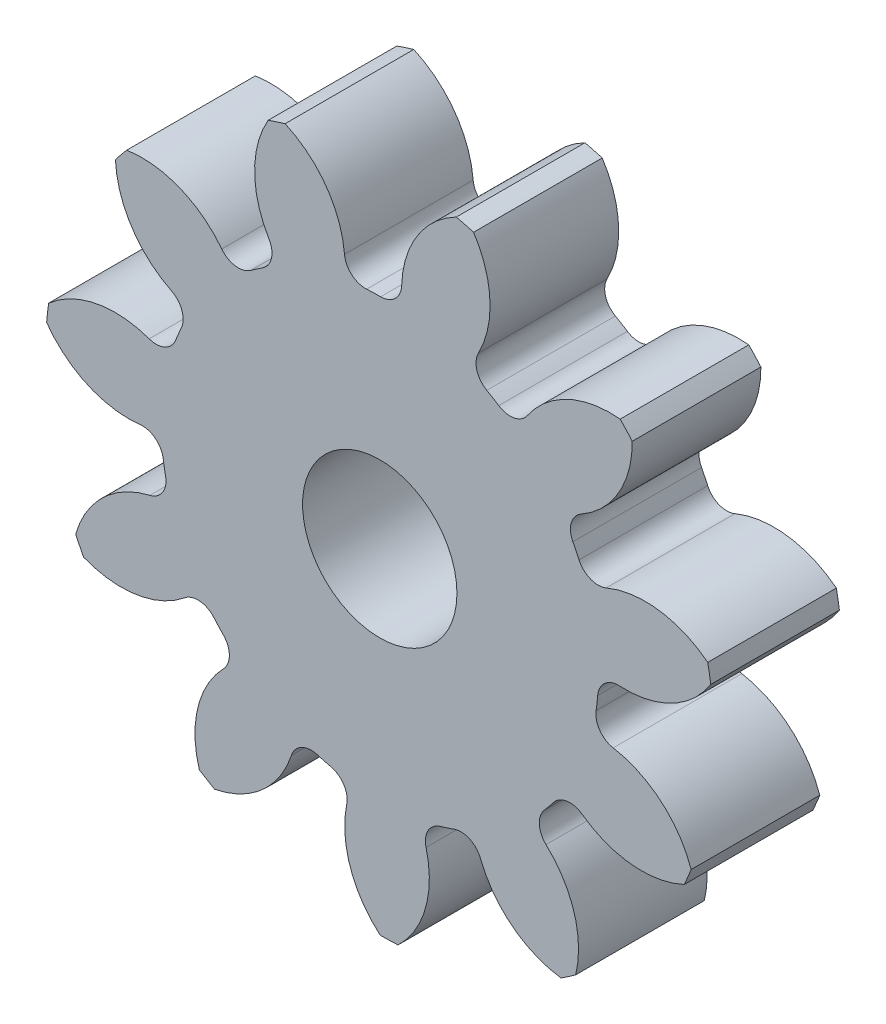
ISO-10303-21;
HEADER;
FILE_DESCRIPTION(('STEP AP214'),'2;1');
FILE_NAME('part.step','',(''),(''),'','','');
FILE_SCHEMA(('AUTOMOTIVE_DESIGN { 1 0 10303 214 1 1 1 1 }'));
ENDSEC;
DATA;
#1=APPLICATION_CONTEXT('core data for automotive mechanical design processes');
#2=APPLICATION_PROTOCOL_DEFINITION('international standard','automotive_design',2000,#1);
#3=PRODUCT_CONTEXT('',#1,'mechanical');
#4=PRODUCT('Part','Part','',(#3));
#5=PRODUCT_RELATED_PRODUCT_CATEGORY('part','',(#4));
#6=PRODUCT_DEFINITION_FORMATION('','',#4);
#7=PRODUCT_DEFINITION_CONTEXT('part definition',#1,'design');
#8=PRODUCT_DEFINITION('design','',#6,#7);
#9=PRODUCT_DEFINITION_SHAPE('','',#8);
#10=(LENGTH_UNIT() NAMED_UNIT(*) SI_UNIT(.MILLI.,.METRE.));
#11=(NAMED_UNIT(*) PLANE_ANGLE_UNIT() SI_UNIT($,.RADIAN.));
#12=(NAMED_UNIT(*) SI_UNIT($,.STERADIAN.) SOLID_ANGLE_UNIT());
#13=UNCERTAINTY_MEASURE_WITH_UNIT(LENGTH_MEASURE(1.E-05),#10,'distance_accuracy_value','');
#14=(GEOMETRIC_REPRESENTATION_CONTEXT(3) GLOBAL_UNCERTAINTY_ASSIGNED_CONTEXT((#13)) GLOBAL_UNIT_ASSIGNED_CONTEXT((#10,
#11,#12)) REPRESENTATION_CONTEXT('',''));
#15=CARTESIAN_POINT('',(0.,0.,0.));
#16=DIRECTION('',(0.,0.,1.));
#17=DIRECTION('',(1.,0.,0.));
#18=AXIS2_PLACEMENT_3D('',#15,#16,#17);
#19=CARTESIAN_POINT('',(0.,0.,127.));
#20=DIRECTION('',(0.,0.,-1.));
#21=DIRECTION('',(-1.,0.,0.));
#22=AXIS2_PLACEMENT_3D('',#19,#20,#21);
#23=CYLINDRICAL_SURFACE('',#22,330.2);
#24=DIRECTION('',(0.,0.,-1.));
#25=VECTOR('',#24,1.);
#26=CARTESIAN_POINT('',(323.783196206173,64.7802582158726,63.5));
#27=LINE('',#26,#25);
#28=CARTESIAN_POINT('',(323.783196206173,64.7802582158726,127.));
#29=VERTEX_POINT('',#28);
#30=CARTESIAN_POINT('',(323.783196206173,64.7802582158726,0.));
#31=VERTEX_POINT('',#30);
#32=EDGE_CURVE('E492',#29,#31,#27,.T.);
#33=ORIENTED_EDGE('',*,*,#32,.F.);
#34=CARTESIAN_POINT('',(0.,0.,127.));
#35=DIRECTION('',(0.,0.,1.));
#36=DIRECTION('',(1.,0.,0.));
#37=AXIS2_PLACEMENT_3D('',#34,#35,#36);
#38=CIRCLE('',#37,330.2);
#39=CARTESIAN_POINT('',(326.778328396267,47.4126996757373,127.));
#40=VERTEX_POINT('',#39);
#41=EDGE_CURVE('E871',#40,#29,#38,.T.);
#42=ORIENTED_EDGE('',*,*,#41,.F.);
#43=DIRECTION('',(0.,0.,-1.));
#44=VECTOR('',#43,1.);
#45=CARTESIAN_POINT('',(326.778328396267,47.4126996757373,63.5));
#46=LINE('',#45,#44);
#47=CARTESIAN_POINT('',(326.778328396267,47.4126996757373,0.));
#48=VERTEX_POINT('',#47);
#49=EDGE_CURVE('E865',#48,#40,#46,.F.);
#50=ORIENTED_EDGE('',*,*,#49,.F.);
#51=CARTESIAN_POINT('',(0.,0.,0.));
#52=DIRECTION('',(0.,0.,1.));
#53=DIRECTION('',(1.,0.,0.));
#54=AXIS2_PLACEMENT_3D('',#51,#52,#53);
#55=CIRCLE('',#54,330.2);
#56=EDGE_CURVE('E876',#48,#31,#55,.T.);
#57=ORIENTED_EDGE('',*,*,#56,.T.);
#58=EDGE_LOOP('',(#33,#42,#50,#57));
#59=FACE_BOUND('',#58,.T.);
#60=ADVANCED_FACE('F33',(#59),#23,.T.);
#61=DIRECTION('',(0.,0.,-1.));
#62=VECTOR('',#61,1.);
#63=CARTESIAN_POINT('',(249.270182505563,216.555803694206,63.5));
#64=LINE('',#63,#62);
#65=CARTESIAN_POINT('',(249.270182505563,216.555803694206,0.));
#66=VERTEX_POINT('',#65);
#67=CARTESIAN_POINT('',(249.270182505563,216.555803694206,127.));
#68=VERTEX_POINT('',#67);
#69=EDGE_CURVE('E463',#66,#68,#64,.F.);
#70=ORIENTED_EDGE('',*,*,#69,.F.);
#71=CARTESIAN_POINT('',(237.360905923,229.547032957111,0.));
#72=VERTEX_POINT('',#71);
#73=EDGE_CURVE('E879',#66,#72,#55,.T.);
#74=ORIENTED_EDGE('',*,*,#73,.T.);
#75=DIRECTION('',(0.,0.,-1.));
#76=VECTOR('',#75,1.);
#77=CARTESIAN_POINT('',(237.360905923,229.547032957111,63.5));
#78=LINE('',#77,#76);
#79=CARTESIAN_POINT('',(237.360905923,229.547032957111,127.));
#80=VERTEX_POINT('',#79);
#81=EDGE_CURVE('E525',#80,#72,#78,.T.);
#82=ORIENTED_EDGE('',*,*,#81,.F.);
#83=EDGE_CURVE('E874',#68,#80,#38,.T.);
#84=ORIENTED_EDGE('',*,*,#83,.F.);
#85=EDGE_LOOP('',(#70,#74,#82,#84));
#86=FACE_BOUND('',#85,.T.);
#87=ADVANCED_FACE('F1006',(#86),#23,.T.);
#88=CARTESIAN_POINT('',(0.,0.,127.));
#89=DIRECTION('',(0.,0.,1.));
#90=DIRECTION('',(1.,0.,0.));
#91=AXIS2_PLACEMENT_3D('',#88,#89,#90);
#92=PLANE('',#91);
#93=CARTESIAN_POINT('',(0.,0.,127.000000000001));
#94=DIRECTION('',(0.,0.,1.));
#95=DIRECTION('',(1.,0.,0.));
#96=AXIS2_PLACEMENT_3D('',#93,#94,#95);
#97=CIRCLE('',#96,76.2);
#98=CARTESIAN_POINT('',(76.2,0.,127.000000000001));
#99=VERTEX_POINT('',#98);
#100=EDGE_CURVE('E480',#99,#99,#97,.T.);
#101=ORIENTED_EDGE('',*,*,#100,.F.);
#102=EDGE_LOOP('',(#101));
#103=FACE_BOUND('',#102,.T.);
#104=ORIENTED_EDGE('',*,*,#41,.T.);
#105=CARTESIAN_POINT('',(262.206768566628,-13.4229322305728,127.));
#106=DIRECTION('',(0.,0.,-1.));
#107=DIRECTION('',(0.841253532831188,0.540640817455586,0.));
#108=AXIS2_PLACEMENT_3D('',#105,#106,#107);
#109=CIRCLE('',#108,99.5359002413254);
#110=CARTESIAN_POINT('',(223.617073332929,78.3279852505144,127.));
#111=VERTEX_POINT('',#110);
#112=EDGE_CURVE('E472',#111,#29,#109,.T.);
#113=ORIENTED_EDGE('',*,*,#112,.F.);
#114=CARTESIAN_POINT('',(215.601220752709,97.3864884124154,127.));
#115=DIRECTION('',(0.,0.,1.));
#116=DIRECTION('',(-0.841253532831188,-0.540640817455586,0.));
#117=AXIS2_PLACEMENT_3D('',#114,#115,#116);
#118=CIRCLE('',#117,20.6756);
#119=CARTESIAN_POINT('',(196.758683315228,88.8753652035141,127.));
#120=VERTEX_POINT('',#119);
#121=EDGE_CURVE('E470',#120,#111,#118,.T.);
#122=ORIENTED_EDGE('',*,*,#121,.F.);
#123=CARTESIAN_POINT('',(0.,0.,127.));
#124=DIRECTION('',(0.,0.,-1.));
#125=DIRECTION('',(0.841253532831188,0.540640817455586,0.));
#126=AXIS2_PLACEMENT_3D('',#123,#124,#125);
#127=CIRCLE('',#126,215.9);
#128=CARTESIAN_POINT('',(190.649308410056,101.319549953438,127.));
#129=VERTEX_POINT('',#128);
#130=EDGE_CURVE('E455',#129,#120,#127,.T.);
#131=ORIENTED_EDGE('',*,*,#130,.F.);
#132=CARTESIAN_POINT('',(208.906783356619,111.022386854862,127.));
#133=DIRECTION('',(0.,0.,1.));
#134=DIRECTION('',(-0.841253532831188,-0.540640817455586,0.));
#135=AXIS2_PLACEMENT_3D('',#132,#133,#134);
#136=CIRCLE('',#135,20.6756);
#137=CARTESIAN_POINT('',(198.730183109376,129.020087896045,127.));
#138=VERTEX_POINT('',#137);
#139=EDGE_CURVE('E447',#138,#129,#136,.T.);
#140=ORIENTED_EDGE('',*,*,#139,.F.);
#141=CARTESIAN_POINT('',(149.738276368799,215.664121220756,127.));
#142=DIRECTION('',(0.,0.,-1.));
#143=DIRECTION('',(-0.841253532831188,-0.540640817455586,0.));
#144=AXIS2_PLACEMENT_3D('',#141,#142,#143);
#145=CIRCLE('',#144,99.5359002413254);
#146=EDGE_CURVE('E477',#68,#138,#145,.T.);
#147=ORIENTED_EDGE('',*,*,#146,.F.);
#148=ORIENTED_EDGE('',*,*,#83,.T.);
#149=CARTESIAN_POINT('',(227.839355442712,130.46759254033,127.));
#150=DIRECTION('',(0.,0.,-1.));
#151=DIRECTION('',(0.415415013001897,0.909631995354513,0.));
#152=AXIS2_PLACEMENT_3D('',#149,#150,#151);
#153=CIRCLE('',#152,99.5359002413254);
#154=CARTESIAN_POINT('',(145.771346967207,186.790211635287,127.));
#155=VERTEX_POINT('',#154);
#156=EDGE_CURVE('E501',#155,#80,#153,.T.);
#157=ORIENTED_EDGE('',*,*,#156,.F.);
#158=CARTESIAN_POINT('',(128.724177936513,198.489547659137,127.));
#159=DIRECTION('',(0.,0.,1.));
#160=DIRECTION('',(-0.415415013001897,-0.909631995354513,0.));
#161=AXIS2_PLACEMENT_3D('',#158,#159,#160);
#162=CIRCLE('',#161,20.6756);
#163=CARTESIAN_POINT('',(117.474287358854,181.142490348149,127.));
#164=VERTEX_POINT('',#163);
#165=EDGE_CURVE('E499',#164,#155,#162,.T.);
#166=ORIENTED_EDGE('',*,*,#165,.F.);
#167=CARTESIAN_POINT('',(0.,0.,127.));
#168=DIRECTION('',(0.,0.,-1.));
#169=DIRECTION('',(0.415415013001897,0.909631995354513,0.));
#170=AXIS2_PLACEMENT_3D('',#167,#168,#169);
#171=CIRCLE('',#170,215.9);
#172=CARTESIAN_POINT('',(105.606919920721,188.308227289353,127.));
#173=VERTEX_POINT('',#172);
#174=EDGE_CURVE('E496',#173,#164,#171,.T.);
#175=ORIENTED_EDGE('',*,*,#174,.F.);
#176=CARTESIAN_POINT('',(115.72033554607,206.341509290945,127.));
#177=DIRECTION('',(0.,0.,1.));
#178=DIRECTION('',(-0.415415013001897,-0.909631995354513,0.));
#179=AXIS2_PLACEMENT_3D('',#176,#177,#178);
#180=CIRCLE('',#179,20.6756);
#181=CARTESIAN_POINT('',(97.4289428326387,215.980253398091,127.));
#182=VERTEX_POINT('',#181);
#183=EDGE_CURVE('E494',#182,#173,#180,.T.);
#184=ORIENTED_EDGE('',*,*,#183,.F.);
#185=CARTESIAN_POINT('',(9.37102720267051,262.382828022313,127.));
#186=DIRECTION('',(0.,0.,-1.));
#187=DIRECTION('',(-0.415415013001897,-0.909631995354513,0.));
#188=AXIS2_PLACEMENT_3D('',#185,#186,#187);
#189=CIRCLE('',#188,99.5359002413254);
#190=CARTESIAN_POINT('',(92.6205149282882,316.94397014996,127.));
#191=VERTEX_POINT('',#190);
#192=EDGE_CURVE('E504',#191,#182,#189,.T.);
#193=ORIENTED_EDGE('',*,*,#192,.F.);
#194=CARTESIAN_POINT('',(75.5782051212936,321.434246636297,127.));
#195=VERTEX_POINT('',#194);
#196=EDGE_CURVE('E909',#191,#195,#38,.T.);
#197=ORIENTED_EDGE('',*,*,#196,.T.);
#198=CARTESIAN_POINT('',(121.134556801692,232.935578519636,127.));
#199=DIRECTION('',(0.,0.,-1.));
#200=DIRECTION('',(-0.142314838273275,0.989821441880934,0.));
#201=AXIS2_PLACEMENT_3D('',#198,#199,#200);
#202=CIRCLE('',#201,99.5359002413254);
#203=CARTESIAN_POINT('',(21.644247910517,235.947865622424,127.));
#204=VERTEX_POINT('',#203);
#205=EDGE_CURVE('E536',#204,#195,#202,.T.);
#206=ORIENTED_EDGE('',*,*,#205,.F.);
#207=CARTESIAN_POINT('',(0.978118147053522,236.573577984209,127.));
#208=DIRECTION('',(0.,0.,1.));
#209=DIRECTION('',(0.142314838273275,-0.989821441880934,0.));
#210=AXIS2_PLACEMENT_3D('',#207,#208,#209);
#211=CIRCLE('',#210,20.6756);
#212=CARTESIAN_POINT('',(0.892635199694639,215.898154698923,127.));
#213=VERTEX_POINT('',#212);
#214=EDGE_CURVE('E534',#213,#204,#211,.T.);
#215=ORIENTED_EDGE('',*,*,#214,.F.);
#216=CARTESIAN_POINT('',(0.,0.,127.));
#217=DIRECTION('',(0.,0.,-1.));
#218=DIRECTION('',(-0.142314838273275,0.989821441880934,0.));
#219=AXIS2_PLACEMENT_3D('',#216,#217,#218);
#220=CIRCLE('',#219,215.9);
#221=CARTESIAN_POINT('',(-12.9649194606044,215.510372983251,127.));
#222=VERTEX_POINT('',#221);
#223=EDGE_CURVE('E531',#222,#213,#220,.T.);
#224=ORIENTED_EDGE('',*,*,#223,.F.);
#225=CARTESIAN_POINT('',(-14.2065011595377,236.148660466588,127.));
#226=DIRECTION('',(0.,0.,1.));
#227=DIRECTION('',(0.142314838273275,-0.989821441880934,0.));
#228=AXIS2_PLACEMENT_3D('',#225,#226,#227);
#229=CIRCLE('',#228,20.6756);
#230=CARTESIAN_POINT('',(-34.8052983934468,234.36821448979,127.));
#231=VERTEX_POINT('',#230);
#232=EDGE_CURVE('E529',#231,#222,#229,.T.);
#233=ORIENTED_EDGE('',*,*,#232,.F.);
#234=CARTESIAN_POINT('',(-133.971456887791,225.796840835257,127.));
#235=DIRECTION('',(0.,0.,-1.));
#236=DIRECTION('',(0.142314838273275,-0.989821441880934,0.));
#237=AXIS2_PLACEMENT_3D('',#234,#235,#236);
#238=CIRCLE('',#237,99.5359002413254);
#239=CARTESIAN_POINT('',(-93.4355117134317,316.704665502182,127.));
#240=VERTEX_POINT('',#239);
#241=EDGE_CURVE('E539',#240,#231,#238,.T.);
#242=ORIENTED_EDGE('',*,*,#241,.F.);
#243=CARTESIAN_POINT('',(-110.200041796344,311.268358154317,127.));
#244=VERTEX_POINT('',#243);
#245=EDGE_CURVE('E988',#240,#244,#38,.T.);
#246=ORIENTED_EDGE('',*,*,#245,.T.);
#247=CARTESIAN_POINT('',(-24.0296077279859,261.448164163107,127.));
#248=DIRECTION('',(0.,0.,-1.));
#249=DIRECTION('',(-0.654860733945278,0.755749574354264,0.));
#250=AXIS2_PLACEMENT_3D('',#247,#248,#249);
#251=CIRCLE('',#250,99.5359002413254);
#252=CARTESIAN_POINT('',(-109.354746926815,210.193739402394,127.));
#253=VERTEX_POINT('',#252);
#254=EDGE_CURVE('E574',#253,#244,#251,.T.);
#255=ORIENTED_EDGE('',*,*,#254,.F.);
#256=CARTESIAN_POINT('',(-127.078487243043,199.547168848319,127.));
#257=DIRECTION('',(0.,0.,1.));
#258=DIRECTION('',(0.654860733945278,-0.755749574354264,0.));
#259=AXIS2_PLACEMENT_3D('',#256,#257,#258);
#260=CIRCLE('',#259,20.6756);
#261=CARTESIAN_POINT('',(-115.972422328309,182.107680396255,127.));
#262=VERTEX_POINT('',#261);
#263=EDGE_CURVE('E572',#262,#253,#260,.T.);
#264=ORIENTED_EDGE('',*,*,#263,.F.);
#265=CARTESIAN_POINT('',(0.,0.,127.));
#266=DIRECTION('',(0.,0.,-1.));
#267=DIRECTION('',(-0.654860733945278,0.755749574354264,0.));
#268=AXIS2_PLACEMENT_3D('',#265,#266,#267);
#269=CIRCLE('',#268,215.9);
#270=CARTESIAN_POINT('',(-127.420488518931,174.289497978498,127.));
#271=VERTEX_POINT('',#270);
#272=EDGE_CURVE('E569',#271,#262,#269,.T.);
#273=ORIENTED_EDGE('',*,*,#272,.F.);
#274=CARTESIAN_POINT('',(-139.622874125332,190.980280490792,127.));
#275=DIRECTION('',(0.,0.,1.));
#276=DIRECTION('',(0.654860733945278,-0.755749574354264,0.));
#277=AXIS2_PLACEMENT_3D('',#274,#275,#276);
#278=CIRCLE('',#277,20.6756);
#279=CARTESIAN_POINT('',(-155.9891033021,178.345923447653,127.));
#280=VERTEX_POINT('',#279);
#281=EDGE_CURVE('E567',#280,#271,#278,.T.);
#282=ORIENTED_EDGE('',*,*,#281,.F.);
#283=CARTESIAN_POINT('',(-234.77895001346,117.521952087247,127.));
#284=DIRECTION('',(0.,0.,-1.));
#285=DIRECTION('',(0.654860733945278,-0.755749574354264,0.));
#286=AXIS2_PLACEMENT_3D('',#283,#284,#285);
#287=CIRCLE('',#286,99.5359002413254);
#288=CARTESIAN_POINT('',(-249.826423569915,215.913867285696,127.));
#289=VERTEX_POINT('',#288);
#290=EDGE_CURVE('E577',#289,#280,#287,.T.);
#291=ORIENTED_EDGE('',*,*,#290,.F.);
#292=CARTESIAN_POINT('',(-260.99055407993,202.276965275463,127.));
#293=VERTEX_POINT('',#292);
#294=EDGE_CURVE('E984',#289,#293,#38,.T.);
#295=ORIENTED_EDGE('',*,*,#294,.T.);
#296=CARTESIAN_POINT('',(-161.564541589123,206.952804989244,127.));
#297=DIRECTION('',(0.,0.,-1.));
#298=DIRECTION('',(-0.959492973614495,0.281732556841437,0.));
#299=AXIS2_PLACEMENT_3D('',#296,#297,#298);
#300=CIRCLE('',#299,99.5359002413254);
#301=CARTESIAN_POINT('',(-205.634382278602,117.704586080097,127.));
#302=VERTEX_POINT('',#301);
#303=EDGE_CURVE('E612',#302,#293,#300,.T.);
#304=ORIENTED_EDGE('',*,*,#303,.F.);
#305=CARTESIAN_POINT('',(-214.788570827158,99.1659435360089,127.));
#306=DIRECTION('',(0.,0.,1.));
#307=DIRECTION('',(0.959492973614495,-0.281732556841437,0.));
#308=AXIS2_PLACEMENT_3D('',#305,#306,#307);
#309=CIRCLE('',#308,20.6756);
#310=CARTESIAN_POINT('',(-196.017055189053,90.4993042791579,127.));
#311=VERTEX_POINT('',#310);
#312=EDGE_CURVE('E610',#311,#302,#309,.T.);
#313=ORIENTED_EDGE('',*,*,#312,.F.);
#314=CARTESIAN_POINT('',(0.,0.,127.));
#315=DIRECTION('',(0.,0.,-1.));
#316=DIRECTION('',(-0.959492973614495,0.281732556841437,0.));
#317=AXIS2_PLACEMENT_3D('',#314,#315,#316);
#318=CIRCLE('',#317,215.9);
#319=CARTESIAN_POINT('',(-201.420952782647,77.7329388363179,127.));
#320=VERTEX_POINT('',#319);
#321=EDGE_CURVE('E607',#320,#311,#318,.T.);
#322=ORIENTED_EDGE('',*,*,#321,.F.);
#323=CARTESIAN_POINT('',(-220.70997108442,85.1770108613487,127.));
#324=DIRECTION('',(0.,0.,1.));
#325=DIRECTION('',(0.959492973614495,-0.281732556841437,0.));
#326=AXIS2_PLACEMENT_3D('',#323,#324,#325);
#327=CIRCLE('',#326,20.6756);
#328=CARTESIAN_POINT('',(-227.647470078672,65.700061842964,127.));
#329=VERTEX_POINT('',#328);
#330=EDGE_CURVE('E605',#329,#320,#327,.T.);
#331=ORIENTED_EDGE('',*,*,#330,.F.);
#332=CARTESIAN_POINT('',(-261.045785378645,-28.065326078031,127.));
#333=DIRECTION('',(0.,0.,-1.));
#334=DIRECTION('',(0.959492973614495,-0.281732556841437,0.));
#335=AXIS2_PLACEMENT_3D('',#332,#333,#334);
#336=CIRCLE('',#335,99.5359002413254);
#337=CARTESIAN_POINT('',(-326.899211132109,46.5719417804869,127.));
#338=VERTEX_POINT('',#337);
#339=EDGE_CURVE('E615',#338,#329,#336,.T.);
#340=ORIENTED_EDGE('',*,*,#339,.F.);
#341=CARTESIAN_POINT('',(-328.918409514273,29.0640651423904,127.));
#342=VERTEX_POINT('',#341);
#343=EDGE_CURVE('E980',#338,#342,#38,.T.);
#344=ORIENTED_EDGE('',*,*,#343,.T.);
#345=CARTESIAN_POINT('',(-247.803875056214,86.7513924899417,127.));
#346=DIRECTION('',(0.,0.,-1.));
#347=DIRECTION('',(-0.959492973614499,-0.281732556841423,0.));
#348=AXIS2_PLACEMENT_3D('',#345,#346,#347);
#349=CIRCLE('',#348,99.5359002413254);
#350=CARTESIAN_POINT('',(-236.626554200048,-12.1549416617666,127.));
#351=VERTEX_POINT('',#350);
#352=EDGE_CURVE('E650',#351,#342,#349,.T.);
#353=ORIENTED_EDGE('',*,*,#352,.F.);
#354=CARTESIAN_POINT('',(-234.304800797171,-32.6997681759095,127.));
#355=DIRECTION('',(0.,0.,1.));
#356=DIRECTION('',(0.959492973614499,0.281732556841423,0.));
#357=AXIS2_PLACEMENT_3D('',#354,#355,#356);
#358=CIRCLE('',#357,20.6756);
#359=CARTESIAN_POINT('',(-213.827658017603,-29.8419615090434,127.));
#360=VERTEX_POINT('',#359);
#361=EDGE_CURVE('E648',#360,#351,#358,.T.);
#362=ORIENTED_EDGE('',*,*,#361,.F.);
#363=CARTESIAN_POINT('',(0.,0.,127.));
#364=DIRECTION('',(0.,0.,-1.));
#365=DIRECTION('',(-0.959492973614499,-0.281732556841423,0.));
#366=AXIS2_PLACEMENT_3D('',#363,#364,#365);
#367=CIRCLE('',#366,215.9);
#368=CARTESIAN_POINT('',(-211.471687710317,-43.5032791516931,127.));
#369=VERTEX_POINT('',#368);
#370=EDGE_CURVE('E645',#369,#360,#367,.T.);
#371=ORIENTED_EDGE('',*,*,#370,.F.);
#372=CARTESIAN_POINT('',(-231.72321168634,-47.669357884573,127.));
#373=DIRECTION('',(0.,0.,1.));
#374=DIRECTION('',(0.959492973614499,0.281732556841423,0.));
#375=AXIS2_PLACEMENT_3D('',#372,#373,#374);
#376=CIRCLE('',#375,20.6756);
#377=CARTESIAN_POINT('',(-227.029373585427,-67.8051051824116,127.));
#378=VERTEX_POINT('',#377);
#379=EDGE_CURVE('E643',#378,#369,#376,.T.);
#380=ORIENTED_EDGE('',*,*,#379,.F.);
#381=CARTESIAN_POINT('',(-204.432428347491,-164.742061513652,127.));
#382=DIRECTION('',(0.,0.,-1.));
#383=DIRECTION('',(0.959492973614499,0.281732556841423,0.));
#384=AXIS2_PLACEMENT_3D('',#381,#382,#383);
#385=CIRCLE('',#384,99.5359002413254);
#386=CARTESIAN_POINT('',(-300.183808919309,-137.556246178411,127.));
#387=VERTEX_POINT('',#386);
#388=EDGE_CURVE('E653',#387,#378,#385,.T.);
#389=ORIENTED_EDGE('',*,*,#388,.F.);
#390=CARTESIAN_POINT('',(-292.41699395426,-153.37647031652,127.));
#391=VERTEX_POINT('',#390);
#392=EDGE_CURVE('E976',#387,#391,#38,.T.);
#393=ORIENTED_EDGE('',*,*,#392,.T.);
#394=CARTESIAN_POINT('',(-255.36722909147,-60.992974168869,127.));
#395=DIRECTION('',(0.,0.,-1.));
#396=DIRECTION('',(-0.654860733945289,-0.755749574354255,0.));
#397=AXIS2_PLACEMENT_3D('',#394,#395,#396);
#398=CIRCLE('',#397,99.5359002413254);
#399=CARTESIAN_POINT('',(-192.491467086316,-138.155361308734,127.));
#400=VERTEX_POINT('',#399);
#401=EDGE_CURVE('E688',#400,#391,#398,.T.);
#402=ORIENTED_EDGE('',*,*,#401,.F.);
#403=CARTESIAN_POINT('',(-179.430912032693,-154.183534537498,127.));
#404=DIRECTION('',(0.,0.,1.));
#405=DIRECTION('',(0.654860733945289,0.755749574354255,0.));
#406=AXIS2_PLACEMENT_3D('',#403,#404,#405);
#407=CIRCLE('',#406,20.6756);
#408=CARTESIAN_POINT('',(-163.749490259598,-140.708615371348,127.));
#409=VERTEX_POINT('',#408);
#410=EDGE_CURVE('E686',#409,#400,#407,.T.);
#411=ORIENTED_EDGE('',*,*,#410,.F.);
#412=CARTESIAN_POINT('',(0.,0.,127.));
#413=DIRECTION('',(0.,0.,-1.));
#414=DIRECTION('',(-0.654860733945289,-0.755749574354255,0.));
#415=AXIS2_PLACEMENT_3D('',#412,#413,#414);
#416=CIRCLE('',#415,215.9);
#417=CARTESIAN_POINT('',(-154.381655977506,-150.927513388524,127.));
#418=VERTEX_POINT('',#417);
#419=EDGE_CURVE('E683',#418,#409,#416,.T.);
#420=ORIENTED_EDGE('',*,*,#419,.F.);
#421=CARTESIAN_POINT('',(-169.165969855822,-165.381042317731,127.));
#422=DIRECTION('',(0.,0.,1.));
#423=DIRECTION('',(0.654860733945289,0.755749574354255,0.));
#424=AXIS2_PLACEMENT_3D('',#421,#422,#423);
#425=CIRCLE('',#424,20.6756);
#426=CARTESIAN_POINT('',(-154.331055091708,-179.782630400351,127.));
#427=VERTEX_POINT('',#426);
#428=EDGE_CURVE('E681',#427,#418,#425,.T.);
#429=ORIENTED_EDGE('',*,*,#428,.F.);
#430=CARTESIAN_POINT('',(-82.9132197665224,-249.114356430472,127.));
#431=DIRECTION('',(0.,0.,-1.));
#432=DIRECTION('',(0.654860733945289,0.755749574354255,0.));
#433=AXIS2_PLACEMENT_3D('',#430,#431,#432);
#434=CIRCLE('',#433,99.5359002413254);
#435=CARTESIAN_POINT('',(-178.162168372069,-278.011297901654,127.));
#436=VERTEX_POINT('',#435);
#437=EDGE_CURVE('E691',#436,#427,#434,.T.);
#438=ORIENTED_EDGE('',*,*,#437,.F.);
#439=CARTESIAN_POINT('',(-163.075248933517,-287.121060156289,127.));
#440=VERTEX_POINT('',#439);
#441=EDGE_CURVE('E972',#436,#440,#38,.T.);
#442=ORIENTED_EDGE('',*,*,#441,.T.);
#443=CARTESIAN_POINT('',(-181.853292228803,-189.372502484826,127.));
#444=DIRECTION('',(0.,0.,-1.));
#445=DIRECTION('',(-0.142314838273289,-0.989821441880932,0.));
#446=AXIS2_PLACEMENT_3D('',#443,#444,#445);
#447=CIRCLE('',#446,99.5359002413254);
#448=CARTESIAN_POINT('',(-87.2416992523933,-220.292429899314,127.));
#449=VERTEX_POINT('',#448);
#450=EDGE_CURVE('E726',#449,#440,#447,.T.);
#451=ORIENTED_EDGE('',*,*,#450,.F.);
#452=CARTESIAN_POINT('',(-67.5889764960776,-226.715118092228,127.));
#453=DIRECTION('',(0.,0.,1.));
#454=DIRECTION('',(0.142314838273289,0.989821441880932,0.));
#455=AXIS2_PLACEMENT_3D('',#452,#453,#454);
#456=CIRCLE('',#455,20.6756);
#457=CARTESIAN_POINT('',(-61.6820163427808,-206.901278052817,127.));
#458=VERTEX_POINT('',#457);
#459=EDGE_CURVE('E724',#458,#449,#456,.T.);
#460=ORIENTED_EDGE('',*,*,#459,.F.);
#461=CARTESIAN_POINT('',(0.,0.,127.));
#462=DIRECTION('',(0.,0.,-1.));
#463=DIRECTION('',(-0.142314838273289,-0.989821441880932,0.));
#464=AXIS2_PLACEMENT_3D('',#461,#462,#463);
#465=CIRCLE('',#464,215.9);
#466=CARTESIAN_POINT('',(-48.2765392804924,-210.433328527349,127.));
#467=VERTEX_POINT('',#466);
#468=EDGE_CURVE('E721',#467,#458,#465,.T.);
#469=ORIENTED_EDGE('',*,*,#468,.F.);
#470=CARTESIAN_POINT('',(-52.8997278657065,-230.585414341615,127.));
#471=DIRECTION('',(0.,0.,1.));
#472=DIRECTION('',(0.142314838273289,0.989821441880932,0.));
#473=AXIS2_PLACEMENT_3D('',#470,#471,#472);
#474=CIRCLE('',#473,20.6756);
#475=CARTESIAN_POINT('',(-32.6337170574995,-234.680440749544,127.));
#476=VERTEX_POINT('',#475);
#477=EDGE_CURVE('E719',#476,#467,#474,.T.);
#478=ORIENTED_EDGE('',*,*,#477,.F.);
#479=CARTESIAN_POINT('',(64.9303502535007,-254.394603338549,127.));
#480=DIRECTION('',(0.,0.,-1.));
#481=DIRECTION('',(0.142314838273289,0.989821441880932,0.));
#482=AXIS2_PLACEMENT_3D('',#479,#480,#481);
#483=CIRCLE('',#482,99.5359002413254);
#484=CARTESIAN_POINT('',(0.424701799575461,-330.199726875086,127.));
#485=VERTEX_POINT('',#484);
#486=EDGE_CURVE('E729',#485,#476,#483,.T.);
#487=ORIENTED_EDGE('',*,*,#486,.F.);
#488=CARTESIAN_POINT('',(18.041735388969,-329.706742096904,127.));
#489=VERTEX_POINT('',#488);
#490=EDGE_CURVE('E968',#485,#489,#38,.T.);
#491=ORIENTED_EDGE('',*,*,#490,.T.);
#492=CARTESIAN_POINT('',(-50.6022199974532,-257.627599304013,127.));
#493=DIRECTION('',(0.,0.,-1.));
#494=DIRECTION('',(0.415415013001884,-0.909631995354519,0.));
#495=AXIS2_PLACEMENT_3D('',#492,#493,#494);
#496=CIRCLE('',#495,99.5359002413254);
#497=CARTESIAN_POINT('',(45.706691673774,-232.488208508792,127.));
#498=VERTEX_POINT('',#497);
#499=EDGE_CURVE('E764',#498,#489,#496,.T.);
#500=ORIENTED_EDGE('',*,*,#499,.F.);
#501=CARTESIAN_POINT('',(65.7119815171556,-227.266253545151,127.));
#502=DIRECTION('',(0.,0.,1.));
#503=DIRECTION('',(-0.415415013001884,0.909631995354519,0.));
#504=AXIS2_PLACEMENT_3D('',#501,#502,#503);
#505=CIRCLE('',#504,20.6756);
#506=CARTESIAN_POINT('',(59.9690619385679,-207.404246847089,127.));
#507=VERTEX_POINT('',#506);
#508=EDGE_CURVE('E762',#507,#498,#505,.T.);
#509=ORIENTED_EDGE('',*,*,#508,.F.);
#510=CARTESIAN_POINT('',(0.,0.,127.));
#511=DIRECTION('',(0.,0.,-1.));
#512=DIRECTION('',(0.415415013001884,-0.909631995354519,0.));
#513=AXIS2_PLACEMENT_3D('',#510,#511,#512);
#514=CIRCLE('',#513,215.9);
#515=CARTESIAN_POINT('',(73.1560375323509,-203.128048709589,127.));
#516=VERTEX_POINT('',#515);
#517=EDGE_CURVE('E759',#516,#507,#514,.T.);
#518=ORIENTED_EDGE('',*,*,#517,.F.);
#519=CARTESIAN_POINT('',(80.161803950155,-222.580546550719,127.));
#520=DIRECTION('',(0.,0.,1.));
#521=DIRECTION('',(-0.415415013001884,0.909631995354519,0.));
#522=AXIS2_PLACEMENT_3D('',#519,#520,#521);
#523=CIRCLE('',#522,20.6756);
#524=CARTESIAN_POINT('',(99.4245955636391,-215.068869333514,127.));
#525=VERTEX_POINT('',#524);
#526=EDGE_CURVE('E757',#525,#516,#523,.T.);
#527=ORIENTED_EDGE('',*,*,#526,.F.);
#528=CARTESIAN_POINT('',(192.158992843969,-178.90636115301,127.));
#529=DIRECTION('',(0.,0.,-1.));
#530=DIRECTION('',(-0.415415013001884,0.909631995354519,0.));
#531=AXIS2_PLACEMENT_3D('',#528,#529,#530);
#532=CIRCLE('',#531,99.5359002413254);
#533=CARTESIAN_POINT('',(178.876732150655,-277.55207564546,127.));
#534=VERTEX_POINT('',#533);
#535=EDGE_CURVE('E767',#534,#525,#532,.T.);
#536=ORIENTED_EDGE('',*,*,#535,.F.);
#537=CARTESIAN_POINT('',(193.430596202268,-267.61286301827,127.));
#538=VERTEX_POINT('',#537);
#539=EDGE_CURVE('E967',#534,#538,#38,.T.);
#540=ORIENTED_EDGE('',*,*,#539,.T.);
#541=CARTESIAN_POINT('',(96.714699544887,-244.087753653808,127.));
#542=DIRECTION('',(0.,0.,-1.));
#543=DIRECTION('',(0.841253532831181,-0.540640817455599,0.));
#544=AXIS2_PLACEMENT_3D('',#541,#542,#543);
#545=CIRCLE('',#544,99.5359002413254);
#546=CARTESIAN_POINT('',(164.143530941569,-170.870623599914,127.));
#547=VERTEX_POINT('',#546);
#548=EDGE_CURVE('E802',#547,#538,#545,.T.);
#549=ORIENTED_EDGE('',*,*,#548,.F.);
#550=CARTESIAN_POINT('',(178.149849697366,-155.661959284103,127.));
#551=DIRECTION('',(0.,0.,1.));
#552=DIRECTION('',(-0.841253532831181,0.540640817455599,0.));
#553=AXIS2_PLACEMENT_3D('',#550,#551,#552);
#554=CIRCLE('',#553,20.6756);
#555=CARTESIAN_POINT('',(162.580386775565,-142.057832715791,127.));
#556=VERTEX_POINT('',#555);
#557=EDGE_CURVE('E800',#556,#547,#554,.T.);
#558=ORIENTED_EDGE('',*,*,#557,.F.);
#559=CARTESIAN_POINT('',(0.,0.,127.));
#560=DIRECTION('',(0.,0.,-1.));
#561=DIRECTION('',(0.841253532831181,-0.540640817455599,0.));
#562=AXIS2_PLACEMENT_3D('',#559,#560,#561);
#563=CIRCLE('',#562,215.9);
#564=CARTESIAN_POINT('',(171.362089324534,-131.331048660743,127.));
#565=VERTEX_POINT('',#564);
#566=EDGE_CURVE('E797',#565,#556,#563,.T.);
#567=ORIENTED_EDGE('',*,*,#566,.F.);
#568=CARTESIAN_POINT('',(187.772529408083,-143.90792790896,127.));
#569=DIRECTION('',(0.,0.,1.));
#570=DIRECTION('',(-0.841253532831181,0.540640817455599,0.));
#571=AXIS2_PLACEMENT_3D('',#568,#569,#570);
#572=CIRCLE('',#571,20.6756);
#573=CARTESIAN_POINT('',(199.916301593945,-127.174451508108,127.));
#574=VERTEX_POINT('',#573);
#575=EDGE_CURVE('E795',#574,#565,#572,.T.);
#576=ORIENTED_EDGE('',*,*,#575,.F.);
#577=CARTESIAN_POINT('',(258.37851293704,-46.6166133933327,127.));
#578=DIRECTION('',(0.,0.,-1.));
#579=DIRECTION('',(-0.841253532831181,0.540640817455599,0.));
#580=AXIS2_PLACEMENT_3D('',#577,#578,#579);
#581=CIRCLE('',#580,99.5359002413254);
#582=CARTESIAN_POINT('',(300.536663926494,-136.783601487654,127.));
#583=VERTEX_POINT('',#582);
#584=EDGE_CURVE('E805',#583,#574,#581,.T.);
#585=ORIENTED_EDGE('',*,*,#584,.F.);
#586=CARTESIAN_POINT('',(307.40660943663,-120.553790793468,127.));
#587=VERTEX_POINT('',#586);
#588=EDGE_CURVE('E875',#583,#587,#38,.T.);
#589=ORIENTED_EDGE('',*,*,#588,.T.);
#590=CARTESIAN_POINT('',(213.325385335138,-153.051770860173,127.));
#591=DIRECTION('',(0.,0.,-1.));
#592=DIRECTION('',(1.,0.,0.));
#593=AXIS2_PLACEMENT_3D('',#590,#591,#592);
#594=CIRCLE('',#593,99.5359002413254);
#595=CARTESIAN_POINT('',(230.465958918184,-55.0028230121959,127.));
#596=VERTEX_POINT('',#595);
#597=EDGE_CURVE('E840',#596,#587,#594,.T.);
#598=ORIENTED_EDGE('',*,*,#597,.F.);
#599=CARTESIAN_POINT('',(234.026399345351,-34.636092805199,127.));
#600=DIRECTION('',(0.,0.,1.));
#601=DIRECTION('',(-1.,0.,0.));
#602=AXIS2_PLACEMENT_3D('',#599,#600,#601);
#603=CIRCLE('',#602,20.6756);
#604=CARTESIAN_POINT('',(213.57358754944,-31.6090604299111,127.));
#605=VERTEX_POINT('',#604);
#606=EDGE_CURVE('E838',#605,#596,#603,.T.);
#607=ORIENTED_EDGE('',*,*,#606,.F.);
#608=CARTESIAN_POINT('',(0.,0.,127.));
#609=DIRECTION('',(0.,0.,-1.));
#610=DIRECTION('',(1.,0.,0.));
#611=AXIS2_PLACEMENT_3D('',#608,#609,#610);
#612=CIRCLE('',#611,215.9);
#613=CARTESIAN_POINT('',(215.161888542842,-17.8373686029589,127.));
#614=VERTEX_POINT('',#613);
#615=EDGE_CURVE('E835',#614,#605,#612,.T.);
#616=ORIENTED_EDGE('',*,*,#615,.F.);
#617=CARTESIAN_POINT('',(235.766803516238,-19.5455589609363,127.));
#618=DIRECTION('',(0.,0.,1.));
#619=DIRECTION('',(-1.,0.,0.));
#620=AXIS2_PLACEMENT_3D('',#617,#618,#619);
#621=CIRCLE('',#620,20.6756);
#622=CARTESIAN_POINT('',(236.935994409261,1.09695609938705,127.));
#623=VERTEX_POINT('',#622);
#624=EDGE_CURVE('E833',#623,#614,#621,.T.);
#625=ORIENTED_EDGE('',*,*,#624,.F.);
#626=CARTESIAN_POINT('',(242.564680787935,100.473579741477,127.));
#627=DIRECTION('',(0.,0.,-1.));
#628=DIRECTION('',(-1.,0.,0.));
#629=AXIS2_PLACEMENT_3D('',#626,#627,#628);
#630=CIRCLE('',#629,99.5359002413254);
#631=EDGE_CURVE('E843',#40,#623,#630,.T.);
#632=ORIENTED_EDGE('',*,*,#631,.F.);
#633=EDGE_LOOP('',(#104,#113,#122,#131,#140,#147,#148,#157,#166,#175,#184,#193,#197,#206,#215,
#224,#233,#242,#246,#255,#264,#273,#282,#291,#295,#304,#313,#322,#331,#340,#344,#353,#362,#371,
#380,#389,#393,#402,#411,#420,#429,#438,#442,#451,#460,#469,#478,#487,#491,#500,#509,#518,#527,
#536,#540,#549,#558,#567,#576,#585,#589,#598,#607,#616,#625,#632));
#634=FACE_BOUND('',#633,.T.);
#635=ADVANCED_FACE('F468',(#103,#634),#92,.T.);
#636=CARTESIAN_POINT('',(0.,0.,0.));
#637=DIRECTION('',(0.,0.,1.));
#638=DIRECTION('',(1.,0.,0.));
#639=AXIS2_PLACEMENT_3D('',#636,#637,#638);
#640=PLANE('',#639);
#641=CARTESIAN_POINT('',(0.,0.,0.));
#642=DIRECTION('',(0.,0.,1.));
#643=DIRECTION('',(1.,0.,0.));
#644=AXIS2_PLACEMENT_3D('',#641,#642,#643);
#645=CIRCLE('',#644,76.2);
#646=CARTESIAN_POINT('',(76.2,0.,-1.77635683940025E-12));
#647=VERTEX_POINT('',#646);
#648=EDGE_CURVE('E36',#647,#647,#645,.T.);
#649=ORIENTED_EDGE('',*,*,#648,.T.);
#650=EDGE_LOOP('',(#649));
#651=FACE_BOUND('',#650,.T.);
#652=CARTESIAN_POINT('',(262.206768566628,-13.4229322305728,0.));
#653=DIRECTION('',(0.,0.,-1.));
#654=DIRECTION('',(0.841253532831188,0.540640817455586,0.));
#655=AXIS2_PLACEMENT_3D('',#652,#653,#654);
#656=CIRCLE('',#655,99.5359002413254);
#657=CARTESIAN_POINT('',(223.617073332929,78.3279852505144,0.));
#658=VERTEX_POINT('',#657);
#659=EDGE_CURVE('E456',#658,#31,#656,.T.);
#660=ORIENTED_EDGE('',*,*,#659,.T.);
#661=ORIENTED_EDGE('',*,*,#56,.F.);
#662=CARTESIAN_POINT('',(242.564680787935,100.473579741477,0.));
#663=DIRECTION('',(0.,0.,1.));
#664=DIRECTION('',(1.,0.,0.));
#665=AXIS2_PLACEMENT_3D('',#662,#663,#664);
#666=CIRCLE('',#665,99.5359002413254);
#667=CARTESIAN_POINT('',(236.935994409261,1.09695609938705,0.));
#668=VERTEX_POINT('',#667);
#669=EDGE_CURVE('E873',#668,#48,#666,.T.);
#670=ORIENTED_EDGE('',*,*,#669,.F.);
#671=CARTESIAN_POINT('',(235.766803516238,-19.5455589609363,0.));
#672=DIRECTION('',(0.,0.,1.));
#673=DIRECTION('',(-1.,0.,0.));
#674=AXIS2_PLACEMENT_3D('',#671,#672,#673);
#675=CIRCLE('',#674,20.6756);
#676=CARTESIAN_POINT('',(215.161888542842,-17.8373686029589,0.));
#677=VERTEX_POINT('',#676);
#678=EDGE_CURVE('E832',#668,#677,#675,.T.);
#679=ORIENTED_EDGE('',*,*,#678,.T.);
#680=CARTESIAN_POINT('',(0.,0.,0.));
#681=DIRECTION('',(0.,0.,-1.));
#682=DIRECTION('',(1.,0.,0.));
#683=AXIS2_PLACEMENT_3D('',#680,#681,#682);
#684=CIRCLE('',#683,215.9);
#685=CARTESIAN_POINT('',(213.57358754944,-31.6090604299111,0.));
#686=VERTEX_POINT('',#685);
#687=EDGE_CURVE('E848',#677,#686,#684,.T.);
#688=ORIENTED_EDGE('',*,*,#687,.T.);
#689=CARTESIAN_POINT('',(234.026399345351,-34.636092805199,0.));
#690=DIRECTION('',(0.,0.,1.));
#691=DIRECTION('',(-1.,0.,0.));
#692=AXIS2_PLACEMENT_3D('',#689,#690,#691);
#693=CIRCLE('',#692,20.6756);
#694=CARTESIAN_POINT('',(230.465958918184,-55.0028230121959,0.));
#695=VERTEX_POINT('',#694);
#696=EDGE_CURVE('E851',#686,#695,#693,.T.);
#697=ORIENTED_EDGE('',*,*,#696,.T.);
#698=CARTESIAN_POINT('',(213.325385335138,-153.051770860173,0.));
#699=DIRECTION('',(0.,0.,-1.));
#700=DIRECTION('',(1.,0.,0.));
#701=AXIS2_PLACEMENT_3D('',#698,#699,#700);
#702=CIRCLE('',#701,99.5359002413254);
#703=CARTESIAN_POINT('',(307.40660943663,-120.553790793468,0.));
#704=VERTEX_POINT('',#703);
#705=EDGE_CURVE('E836',#695,#704,#702,.T.);
#706=ORIENTED_EDGE('',*,*,#705,.T.);
#707=CARTESIAN_POINT('',(300.536663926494,-136.783601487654,0.));
#708=VERTEX_POINT('',#707);
#709=EDGE_CURVE('E870',#708,#704,#55,.T.);
#710=ORIENTED_EDGE('',*,*,#709,.F.);
#711=CARTESIAN_POINT('',(258.37851293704,-46.6166133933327,0.));
#712=DIRECTION('',(0.,0.,1.));
#713=DIRECTION('',(1.,0.,0.));
#714=AXIS2_PLACEMENT_3D('',#711,#712,#713);
#715=CIRCLE('',#714,99.5359002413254);
#716=CARTESIAN_POINT('',(199.916301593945,-127.174451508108,0.));
#717=VERTEX_POINT('',#716);
#718=EDGE_CURVE('E881',#717,#708,#715,.T.);
#719=ORIENTED_EDGE('',*,*,#718,.F.);
#720=CARTESIAN_POINT('',(187.772529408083,-143.90792790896,0.));
#721=DIRECTION('',(0.,0.,1.));
#722=DIRECTION('',(-0.841253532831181,0.540640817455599,0.));
#723=AXIS2_PLACEMENT_3D('',#720,#721,#722);
#724=CIRCLE('',#723,20.6756);
#725=CARTESIAN_POINT('',(171.362089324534,-131.331048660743,0.));
#726=VERTEX_POINT('',#725);
#727=EDGE_CURVE('E794',#717,#726,#724,.T.);
#728=ORIENTED_EDGE('',*,*,#727,.T.);
#729=CARTESIAN_POINT('',(0.,0.,0.));
#730=DIRECTION('',(0.,0.,-1.));
#731=DIRECTION('',(0.841253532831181,-0.540640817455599,0.));
#732=AXIS2_PLACEMENT_3D('',#729,#730,#731);
#733=CIRCLE('',#732,215.9);
#734=CARTESIAN_POINT('',(162.580386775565,-142.057832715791,0.));
#735=VERTEX_POINT('',#734);
#736=EDGE_CURVE('E810',#726,#735,#733,.T.);
#737=ORIENTED_EDGE('',*,*,#736,.T.);
#738=CARTESIAN_POINT('',(178.149849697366,-155.661959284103,0.));
#739=DIRECTION('',(0.,0.,1.));
#740=DIRECTION('',(-0.841253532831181,0.540640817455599,0.));
#741=AXIS2_PLACEMENT_3D('',#738,#739,#740);
#742=CIRCLE('',#741,20.6756);
#743=CARTESIAN_POINT('',(164.143530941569,-170.870623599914,0.));
#744=VERTEX_POINT('',#743);
#745=EDGE_CURVE('E813',#735,#744,#742,.T.);
#746=ORIENTED_EDGE('',*,*,#745,.T.);
#747=CARTESIAN_POINT('',(96.714699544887,-244.087753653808,0.));
#748=DIRECTION('',(0.,0.,-1.));
#749=DIRECTION('',(0.841253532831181,-0.540640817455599,0.));
#750=AXIS2_PLACEMENT_3D('',#747,#748,#749);
#751=CIRCLE('',#750,99.5359002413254);
#752=CARTESIAN_POINT('',(193.430596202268,-267.61286301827,0.));
#753=VERTEX_POINT('',#752);
#754=EDGE_CURVE('E798',#744,#753,#751,.T.);
#755=ORIENTED_EDGE('',*,*,#754,.T.);
#756=CARTESIAN_POINT('',(178.876732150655,-277.55207564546,0.));
#757=VERTEX_POINT('',#756);
#758=EDGE_CURVE('E938',#757,#753,#55,.T.);
#759=ORIENTED_EDGE('',*,*,#758,.F.);
#760=CARTESIAN_POINT('',(192.158992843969,-178.90636115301,0.));
#761=DIRECTION('',(0.,0.,1.));
#762=DIRECTION('',(1.,0.,0.));
#763=AXIS2_PLACEMENT_3D('',#760,#761,#762);
#764=CIRCLE('',#763,99.5359002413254);
#765=CARTESIAN_POINT('',(99.4245955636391,-215.068869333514,0.));
#766=VERTEX_POINT('',#765);
#767=EDGE_CURVE('E883',#766,#757,#764,.T.);
#768=ORIENTED_EDGE('',*,*,#767,.F.);
#769=CARTESIAN_POINT('',(80.161803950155,-222.580546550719,0.));
#770=DIRECTION('',(0.,0.,1.));
#771=DIRECTION('',(-0.415415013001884,0.909631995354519,0.));
#772=AXIS2_PLACEMENT_3D('',#769,#770,#771);
#773=CIRCLE('',#772,20.6756);
#774=CARTESIAN_POINT('',(73.1560375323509,-203.128048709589,0.));
#775=VERTEX_POINT('',#774);
#776=EDGE_CURVE('E756',#766,#775,#773,.T.);
#777=ORIENTED_EDGE('',*,*,#776,.T.);
#778=CARTESIAN_POINT('',(0.,0.,0.));
#779=DIRECTION('',(0.,0.,-1.));
#780=DIRECTION('',(0.415415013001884,-0.909631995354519,0.));
#781=AXIS2_PLACEMENT_3D('',#778,#779,#780);
#782=CIRCLE('',#781,215.9);
#783=CARTESIAN_POINT('',(59.9690619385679,-207.404246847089,0.));
#784=VERTEX_POINT('',#783);
#785=EDGE_CURVE('E772',#775,#784,#782,.T.);
#786=ORIENTED_EDGE('',*,*,#785,.T.);
#787=CARTESIAN_POINT('',(65.7119815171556,-227.266253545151,0.));
#788=DIRECTION('',(0.,0.,1.));
#789=DIRECTION('',(-0.415415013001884,0.909631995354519,0.));
#790=AXIS2_PLACEMENT_3D('',#787,#788,#789);
#791=CIRCLE('',#790,20.6756);
#792=CARTESIAN_POINT('',(45.706691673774,-232.488208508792,0.));
#793=VERTEX_POINT('',#792);
#794=EDGE_CURVE('E775',#784,#793,#791,.T.);
#795=ORIENTED_EDGE('',*,*,#794,.T.);
#796=CARTESIAN_POINT('',(-50.6022199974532,-257.627599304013,0.));
#797=DIRECTION('',(0.,0.,-1.));
#798=DIRECTION('',(0.415415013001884,-0.909631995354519,0.));
#799=AXIS2_PLACEMENT_3D('',#796,#797,#798);
#800=CIRCLE('',#799,99.5359002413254);
#801=CARTESIAN_POINT('',(18.041735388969,-329.706742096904,0.));
#802=VERTEX_POINT('',#801);
#803=EDGE_CURVE('E760',#793,#802,#800,.T.);
#804=ORIENTED_EDGE('',*,*,#803,.T.);
#805=CARTESIAN_POINT('',(0.424701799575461,-330.199726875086,0.));
#806=VERTEX_POINT('',#805);
#807=EDGE_CURVE('E933',#806,#802,#55,.T.);
#808=ORIENTED_EDGE('',*,*,#807,.F.);
#809=CARTESIAN_POINT('',(64.9303502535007,-254.394603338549,0.));
#810=DIRECTION('',(0.,0.,1.));
#811=DIRECTION('',(1.,0.,0.));
#812=AXIS2_PLACEMENT_3D('',#809,#810,#811);
#813=CIRCLE('',#812,99.5359002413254);
#814=CARTESIAN_POINT('',(-32.6337170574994,-234.680440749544,0.));
#815=VERTEX_POINT('',#814);
#816=EDGE_CURVE('E885',#815,#806,#813,.T.);
#817=ORIENTED_EDGE('',*,*,#816,.F.);
#818=CARTESIAN_POINT('',(-52.8997278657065,-230.585414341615,0.));
#819=DIRECTION('',(0.,0.,1.));
#820=DIRECTION('',(0.142314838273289,0.989821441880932,0.));
#821=AXIS2_PLACEMENT_3D('',#818,#819,#820);
#822=CIRCLE('',#821,20.6756);
#823=CARTESIAN_POINT('',(-48.2765392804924,-210.433328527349,0.));
#824=VERTEX_POINT('',#823);
#825=EDGE_CURVE('E718',#815,#824,#822,.T.);
#826=ORIENTED_EDGE('',*,*,#825,.T.);
#827=CARTESIAN_POINT('',(0.,0.,0.));
#828=DIRECTION('',(0.,0.,-1.));
#829=DIRECTION('',(-0.142314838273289,-0.989821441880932,0.));
#830=AXIS2_PLACEMENT_3D('',#827,#828,#829);
#831=CIRCLE('',#830,215.9);
#832=CARTESIAN_POINT('',(-61.6820163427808,-206.901278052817,0.));
#833=VERTEX_POINT('',#832);
#834=EDGE_CURVE('E734',#824,#833,#831,.T.);
#835=ORIENTED_EDGE('',*,*,#834,.T.);
#836=CARTESIAN_POINT('',(-67.5889764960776,-226.715118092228,0.));
#837=DIRECTION('',(0.,0.,1.));
#838=DIRECTION('',(0.142314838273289,0.989821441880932,0.));
#839=AXIS2_PLACEMENT_3D('',#836,#837,#838);
#840=CIRCLE('',#839,20.6756);
#841=CARTESIAN_POINT('',(-87.2416992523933,-220.292429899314,0.));
#842=VERTEX_POINT('',#841);
#843=EDGE_CURVE('E737',#833,#842,#840,.T.);
#844=ORIENTED_EDGE('',*,*,#843,.T.);
#845=CARTESIAN_POINT('',(-181.853292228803,-189.372502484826,0.));
#846=DIRECTION('',(0.,0.,-1.));
#847=DIRECTION('',(-0.142314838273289,-0.989821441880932,0.));
#848=AXIS2_PLACEMENT_3D('',#845,#846,#847);
#849=CIRCLE('',#848,99.5359002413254);
#850=CARTESIAN_POINT('',(-163.075248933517,-287.121060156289,0.));
#851=VERTEX_POINT('',#850);
#852=EDGE_CURVE('E722',#842,#851,#849,.T.);
#853=ORIENTED_EDGE('',*,*,#852,.T.);
#854=CARTESIAN_POINT('',(-178.162168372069,-278.011297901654,0.));
#855=VERTEX_POINT('',#854);
#856=EDGE_CURVE('E928',#855,#851,#55,.T.);
#857=ORIENTED_EDGE('',*,*,#856,.F.);
#858=CARTESIAN_POINT('',(-82.9132197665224,-249.114356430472,0.));
#859=DIRECTION('',(0.,0.,1.));
#860=DIRECTION('',(1.,0.,0.));
#861=AXIS2_PLACEMENT_3D('',#858,#859,#860);
#862=CIRCLE('',#861,99.5359002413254);
#863=CARTESIAN_POINT('',(-154.331055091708,-179.782630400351,0.));
#864=VERTEX_POINT('',#863);
#865=EDGE_CURVE('E887',#864,#855,#862,.T.);
#866=ORIENTED_EDGE('',*,*,#865,.F.);
#867=CARTESIAN_POINT('',(-169.165969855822,-165.381042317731,0.));
#868=DIRECTION('',(0.,0.,1.));
#869=DIRECTION('',(0.654860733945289,0.755749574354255,0.));
#870=AXIS2_PLACEMENT_3D('',#867,#868,#869);
#871=CIRCLE('',#870,20.6756);
#872=CARTESIAN_POINT('',(-154.381655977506,-150.927513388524,0.));
#873=VERTEX_POINT('',#872);
#874=EDGE_CURVE('E680',#864,#873,#871,.T.);
#875=ORIENTED_EDGE('',*,*,#874,.T.);
#876=CARTESIAN_POINT('',(0.,0.,0.));
#877=DIRECTION('',(0.,0.,-1.));
#878=DIRECTION('',(-0.654860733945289,-0.755749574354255,0.));
#879=AXIS2_PLACEMENT_3D('',#876,#877,#878);
#880=CIRCLE('',#879,215.9);
#881=CARTESIAN_POINT('',(-163.749490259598,-140.708615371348,0.));
#882=VERTEX_POINT('',#881);
#883=EDGE_CURVE('E696',#873,#882,#880,.T.);
#884=ORIENTED_EDGE('',*,*,#883,.T.);
#885=CARTESIAN_POINT('',(-179.430912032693,-154.183534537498,0.));
#886=DIRECTION('',(0.,0.,1.));
#887=DIRECTION('',(0.654860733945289,0.755749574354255,0.));
#888=AXIS2_PLACEMENT_3D('',#885,#886,#887);
#889=CIRCLE('',#888,20.6756);
#890=CARTESIAN_POINT('',(-192.491467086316,-138.155361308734,0.));
#891=VERTEX_POINT('',#890);
#892=EDGE_CURVE('E699',#882,#891,#889,.T.);
#893=ORIENTED_EDGE('',*,*,#892,.T.);
#894=CARTESIAN_POINT('',(-255.36722909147,-60.992974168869,0.));
#895=DIRECTION('',(0.,0.,-1.));
#896=DIRECTION('',(-0.654860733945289,-0.755749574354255,0.));
#897=AXIS2_PLACEMENT_3D('',#894,#895,#896);
#898=CIRCLE('',#897,99.5359002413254);
#899=CARTESIAN_POINT('',(-292.41699395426,-153.37647031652,0.));
#900=VERTEX_POINT('',#899);
#901=EDGE_CURVE('E684',#891,#900,#898,.T.);
#902=ORIENTED_EDGE('',*,*,#901,.T.);
#903=CARTESIAN_POINT('',(-300.183808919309,-137.556246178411,0.));
#904=VERTEX_POINT('',#903);
#905=EDGE_CURVE('E923',#904,#900,#55,.T.);
#906=ORIENTED_EDGE('',*,*,#905,.F.);
#907=CARTESIAN_POINT('',(-204.432428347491,-164.742061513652,0.));
#908=DIRECTION('',(0.,0.,1.));
#909=DIRECTION('',(1.,0.,0.));
#910=AXIS2_PLACEMENT_3D('',#907,#908,#909);
#911=CIRCLE('',#910,99.5359002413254);
#912=CARTESIAN_POINT('',(-227.029373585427,-67.8051051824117,0.));
#913=VERTEX_POINT('',#912);
#914=EDGE_CURVE('E889',#913,#904,#911,.T.);
#915=ORIENTED_EDGE('',*,*,#914,.F.);
#916=CARTESIAN_POINT('',(-231.72321168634,-47.669357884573,0.));
#917=DIRECTION('',(0.,0.,1.));
#918=DIRECTION('',(0.959492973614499,0.281732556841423,0.));
#919=AXIS2_PLACEMENT_3D('',#916,#917,#918);
#920=CIRCLE('',#919,20.6756);
#921=CARTESIAN_POINT('',(-211.471687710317,-43.5032791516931,0.));
#922=VERTEX_POINT('',#921);
#923=EDGE_CURVE('E642',#913,#922,#920,.T.);
#924=ORIENTED_EDGE('',*,*,#923,.T.);
#925=CARTESIAN_POINT('',(0.,0.,0.));
#926=DIRECTION('',(0.,0.,-1.));
#927=DIRECTION('',(-0.959492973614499,-0.281732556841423,0.));
#928=AXIS2_PLACEMENT_3D('',#925,#926,#927);
#929=CIRCLE('',#928,215.9);
#930=CARTESIAN_POINT('',(-213.827658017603,-29.8419615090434,0.));
#931=VERTEX_POINT('',#930);
#932=EDGE_CURVE('E658',#922,#931,#929,.T.);
#933=ORIENTED_EDGE('',*,*,#932,.T.);
#934=CARTESIAN_POINT('',(-234.304800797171,-32.6997681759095,0.));
#935=DIRECTION('',(0.,0.,1.));
#936=DIRECTION('',(0.959492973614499,0.281732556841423,0.));
#937=AXIS2_PLACEMENT_3D('',#934,#935,#936);
#938=CIRCLE('',#937,20.6756);
#939=CARTESIAN_POINT('',(-236.626554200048,-12.1549416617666,0.));
#940=VERTEX_POINT('',#939);
#941=EDGE_CURVE('E661',#931,#940,#938,.T.);
#942=ORIENTED_EDGE('',*,*,#941,.T.);
#943=CARTESIAN_POINT('',(-247.803875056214,86.7513924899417,0.));
#944=DIRECTION('',(0.,0.,-1.));
#945=DIRECTION('',(-0.959492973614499,-0.281732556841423,0.));
#946=AXIS2_PLACEMENT_3D('',#943,#944,#945);
#947=CIRCLE('',#946,99.5359002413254);
#948=CARTESIAN_POINT('',(-328.918409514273,29.0640651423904,0.));
#949=VERTEX_POINT('',#948);
#950=EDGE_CURVE('E646',#940,#949,#947,.T.);
#951=ORIENTED_EDGE('',*,*,#950,.T.);
#952=CARTESIAN_POINT('',(-326.899211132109,46.5719417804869,0.));
#953=VERTEX_POINT('',#952);
#954=EDGE_CURVE('E918',#953,#949,#55,.T.);
#955=ORIENTED_EDGE('',*,*,#954,.F.);
#956=CARTESIAN_POINT('',(-261.045785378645,-28.065326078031,0.));
#957=DIRECTION('',(0.,0.,1.));
#958=DIRECTION('',(1.,0.,0.));
#959=AXIS2_PLACEMENT_3D('',#956,#957,#958);
#960=CIRCLE('',#959,99.5359002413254);
#961=CARTESIAN_POINT('',(-227.647470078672,65.700061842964,0.));
#962=VERTEX_POINT('',#961);
#963=EDGE_CURVE('E891',#962,#953,#960,.T.);
#964=ORIENTED_EDGE('',*,*,#963,.F.);
#965=CARTESIAN_POINT('',(-220.70997108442,85.1770108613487,0.));
#966=DIRECTION('',(0.,0.,1.));
#967=DIRECTION('',(0.959492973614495,-0.281732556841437,0.));
#968=AXIS2_PLACEMENT_3D('',#965,#966,#967);
#969=CIRCLE('',#968,20.6756);
#970=CARTESIAN_POINT('',(-201.420952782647,77.7329388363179,0.));
#971=VERTEX_POINT('',#970);
#972=EDGE_CURVE('E604',#962,#971,#969,.T.);
#973=ORIENTED_EDGE('',*,*,#972,.T.);
#974=CARTESIAN_POINT('',(0.,0.,0.));
#975=DIRECTION('',(0.,0.,-1.));
#976=DIRECTION('',(-0.959492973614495,0.281732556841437,0.));
#977=AXIS2_PLACEMENT_3D('',#974,#975,#976);
#978=CIRCLE('',#977,215.9);
#979=CARTESIAN_POINT('',(-196.017055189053,90.4993042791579,0.));
#980=VERTEX_POINT('',#979);
#981=EDGE_CURVE('E620',#971,#980,#978,.T.);
#982=ORIENTED_EDGE('',*,*,#981,.T.);
#983=CARTESIAN_POINT('',(-214.788570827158,99.1659435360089,0.));
#984=DIRECTION('',(0.,0.,1.));
#985=DIRECTION('',(0.959492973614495,-0.281732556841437,0.));
#986=AXIS2_PLACEMENT_3D('',#983,#984,#985);
#987=CIRCLE('',#986,20.6756);
#988=CARTESIAN_POINT('',(-205.634382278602,117.704586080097,0.));
#989=VERTEX_POINT('',#988);
#990=EDGE_CURVE('E623',#980,#989,#987,.T.);
#991=ORIENTED_EDGE('',*,*,#990,.T.);
#992=CARTESIAN_POINT('',(-161.564541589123,206.952804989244,0.));
#993=DIRECTION('',(0.,0.,-1.));
#994=DIRECTION('',(-0.959492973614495,0.281732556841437,0.));
#995=AXIS2_PLACEMENT_3D('',#992,#993,#994);
#996=CIRCLE('',#995,99.5359002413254);
#997=CARTESIAN_POINT('',(-260.99055407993,202.276965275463,0.));
#998=VERTEX_POINT('',#997);
#999=EDGE_CURVE('E608',#989,#998,#996,.T.);
#1000=ORIENTED_EDGE('',*,*,#999,.T.);
#1001=CARTESIAN_POINT('',(-249.826423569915,215.913867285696,0.));
#1002=VERTEX_POINT('',#1001);
#1003=EDGE_CURVE('E913',#1002,#998,#55,.T.);
#1004=ORIENTED_EDGE('',*,*,#1003,.F.);
#1005=CARTESIAN_POINT('',(-234.77895001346,117.521952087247,0.));
#1006=DIRECTION('',(0.,0.,1.));
#1007=DIRECTION('',(1.,0.,0.));
#1008=AXIS2_PLACEMENT_3D('',#1005,#1006,#1007);
#1009=CIRCLE('',#1008,99.5359002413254);
#1010=CARTESIAN_POINT('',(-155.9891033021,178.345923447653,0.));
#1011=VERTEX_POINT('',#1010);
#1012=EDGE_CURVE('E893',#1011,#1002,#1009,.T.);
#1013=ORIENTED_EDGE('',*,*,#1012,.F.);
#1014=CARTESIAN_POINT('',(-139.622874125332,190.980280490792,0.));
#1015=DIRECTION('',(0.,0.,1.));
#1016=DIRECTION('',(0.654860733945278,-0.755749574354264,0.));
#1017=AXIS2_PLACEMENT_3D('',#1014,#1015,#1016);
#1018=CIRCLE('',#1017,20.6756);
#1019=CARTESIAN_POINT('',(-127.420488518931,174.289497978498,0.));
#1020=VERTEX_POINT('',#1019);
#1021=EDGE_CURVE('E566',#1011,#1020,#1018,.T.);
#1022=ORIENTED_EDGE('',*,*,#1021,.T.);
#1023=CARTESIAN_POINT('',(0.,0.,0.));
#1024=DIRECTION('',(0.,0.,-1.));
#1025=DIRECTION('',(-0.654860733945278,0.755749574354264,0.));
#1026=AXIS2_PLACEMENT_3D('',#1023,#1024,#1025);
#1027=CIRCLE('',#1026,215.9);
#1028=CARTESIAN_POINT('',(-115.972422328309,182.107680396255,0.));
#1029=VERTEX_POINT('',#1028);
#1030=EDGE_CURVE('E582',#1020,#1029,#1027,.T.);
#1031=ORIENTED_EDGE('',*,*,#1030,.T.);
#1032=CARTESIAN_POINT('',(-127.078487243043,199.547168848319,0.));
#1033=DIRECTION('',(0.,0.,1.));
#1034=DIRECTION('',(0.654860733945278,-0.755749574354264,0.));
#1035=AXIS2_PLACEMENT_3D('',#1032,#1033,#1034);
#1036=CIRCLE('',#1035,20.6756);
#1037=CARTESIAN_POINT('',(-109.354746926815,210.193739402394,0.));
#1038=VERTEX_POINT('',#1037);
#1039=EDGE_CURVE('E585',#1029,#1038,#1036,.T.);
#1040=ORIENTED_EDGE('',*,*,#1039,.T.);
#1041=CARTESIAN_POINT('',(-24.0296077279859,261.448164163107,0.));
#1042=DIRECTION('',(0.,0.,-1.));
#1043=DIRECTION('',(-0.654860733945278,0.755749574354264,0.));
#1044=AXIS2_PLACEMENT_3D('',#1041,#1042,#1043);
#1045=CIRCLE('',#1044,99.5359002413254);
#1046=CARTESIAN_POINT('',(-110.200041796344,311.268358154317,0.));
#1047=VERTEX_POINT('',#1046);
#1048=EDGE_CURVE('E570',#1038,#1047,#1045,.T.);
#1049=ORIENTED_EDGE('',*,*,#1048,.T.);
#1050=CARTESIAN_POINT('',(-93.4355117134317,316.704665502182,0.));
#1051=VERTEX_POINT('',#1050);
#1052=EDGE_CURVE('E912',#1051,#1047,#55,.T.);
#1053=ORIENTED_EDGE('',*,*,#1052,.F.);
#1054=CARTESIAN_POINT('',(-133.971456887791,225.796840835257,0.));
#1055=DIRECTION('',(0.,0.,1.));
#1056=DIRECTION('',(1.,0.,0.));
#1057=AXIS2_PLACEMENT_3D('',#1054,#1055,#1056);
#1058=CIRCLE('',#1057,99.5359002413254);
#1059=CARTESIAN_POINT('',(-34.8052983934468,234.36821448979,0.));
#1060=VERTEX_POINT('',#1059);
#1061=EDGE_CURVE('E895',#1060,#1051,#1058,.T.);
#1062=ORIENTED_EDGE('',*,*,#1061,.F.);
#1063=CARTESIAN_POINT('',(-14.2065011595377,236.148660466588,0.));
#1064=DIRECTION('',(0.,0.,1.));
#1065=DIRECTION('',(0.142314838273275,-0.989821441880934,0.));
#1066=AXIS2_PLACEMENT_3D('',#1063,#1064,#1065);
#1067=CIRCLE('',#1066,20.6756);
#1068=CARTESIAN_POINT('',(-12.9649194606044,215.510372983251,0.));
#1069=VERTEX_POINT('',#1068);
#1070=EDGE_CURVE('E528',#1060,#1069,#1067,.T.);
#1071=ORIENTED_EDGE('',*,*,#1070,.T.);
#1072=CARTESIAN_POINT('',(0.,0.,0.));
#1073=DIRECTION('',(0.,0.,-1.));
#1074=DIRECTION('',(-0.142314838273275,0.989821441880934,0.));
#1075=AXIS2_PLACEMENT_3D('',#1072,#1073,#1074);
#1076=CIRCLE('',#1075,215.9);
#1077=CARTESIAN_POINT('',(0.892635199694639,215.898154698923,0.));
#1078=VERTEX_POINT('',#1077);
#1079=EDGE_CURVE('E544',#1069,#1078,#1076,.T.);
#1080=ORIENTED_EDGE('',*,*,#1079,.T.);
#1081=CARTESIAN_POINT('',(0.978118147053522,236.573577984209,0.));
#1082=DIRECTION('',(0.,0.,1.));
#1083=DIRECTION('',(0.142314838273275,-0.989821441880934,0.));
#1084=AXIS2_PLACEMENT_3D('',#1081,#1082,#1083);
#1085=CIRCLE('',#1084,20.6756);
#1086=CARTESIAN_POINT('',(21.644247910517,235.947865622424,0.));
#1087=VERTEX_POINT('',#1086);
#1088=EDGE_CURVE('E547',#1078,#1087,#1085,.T.);
#1089=ORIENTED_EDGE('',*,*,#1088,.T.);
#1090=CARTESIAN_POINT('',(121.134556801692,232.935578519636,0.));
#1091=DIRECTION('',(0.,0.,-1.));
#1092=DIRECTION('',(-0.142314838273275,0.989821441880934,0.));
#1093=AXIS2_PLACEMENT_3D('',#1090,#1091,#1092);
#1094=CIRCLE('',#1093,99.5359002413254);
#1095=CARTESIAN_POINT('',(75.5782051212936,321.434246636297,0.));
#1096=VERTEX_POINT('',#1095);
#1097=EDGE_CURVE('E532',#1087,#1096,#1094,.T.);
#1098=ORIENTED_EDGE('',*,*,#1097,.T.);
#1099=CARTESIAN_POINT('',(92.6205149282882,316.94397014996,0.));
#1100=VERTEX_POINT('',#1099);
#1101=EDGE_CURVE('E908',#1100,#1096,#55,.T.);
#1102=ORIENTED_EDGE('',*,*,#1101,.F.);
#1103=CARTESIAN_POINT('',(9.37102720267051,262.382828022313,0.));
#1104=DIRECTION('',(0.,0.,1.));
#1105=DIRECTION('',(1.,0.,0.));
#1106=AXIS2_PLACEMENT_3D('',#1103,#1104,#1105);
#1107=CIRCLE('',#1106,99.5359002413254);
#1108=CARTESIAN_POINT('',(97.4289428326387,215.980253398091,0.));
#1109=VERTEX_POINT('',#1108);
#1110=EDGE_CURVE('E41',#1109,#1100,#1107,.T.);
#1111=ORIENTED_EDGE('',*,*,#1110,.F.);
#1112=CARTESIAN_POINT('',(115.72033554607,206.341509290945,0.));
#1113=DIRECTION('',(0.,0.,1.));
#1114=DIRECTION('',(-0.415415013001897,-0.909631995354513,0.));
#1115=AXIS2_PLACEMENT_3D('',#1112,#1113,#1114);
#1116=CIRCLE('',#1115,20.6756);
#1117=CARTESIAN_POINT('',(105.606919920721,188.308227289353,0.));
#1118=VERTEX_POINT('',#1117);
#1119=EDGE_CURVE('E56',#1109,#1118,#1116,.T.);
#1120=ORIENTED_EDGE('',*,*,#1119,.T.);
#1121=CARTESIAN_POINT('',(0.,0.,0.));
#1122=DIRECTION('',(0.,0.,-1.));
#1123=DIRECTION('',(0.415415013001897,0.909631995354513,0.));
#1124=AXIS2_PLACEMENT_3D('',#1121,#1122,#1123);
#1125=CIRCLE('',#1124,215.9);
#1126=CARTESIAN_POINT('',(117.474287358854,181.142490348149,0.));
#1127=VERTEX_POINT('',#1126);
#1128=EDGE_CURVE('E508',#1118,#1127,#1125,.T.);
#1129=ORIENTED_EDGE('',*,*,#1128,.T.);
#1130=CARTESIAN_POINT('',(128.724177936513,198.489547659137,0.));
#1131=DIRECTION('',(0.,0.,1.));
#1132=DIRECTION('',(-0.415415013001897,-0.909631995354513,0.));
#1133=AXIS2_PLACEMENT_3D('',#1130,#1131,#1132);
#1134=CIRCLE('',#1133,20.6756);
#1135=CARTESIAN_POINT('',(145.771346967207,186.790211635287,0.));
#1136=VERTEX_POINT('',#1135);
#1137=EDGE_CURVE('E511',#1127,#1136,#1134,.T.);
#1138=ORIENTED_EDGE('',*,*,#1137,.T.);
#1139=CARTESIAN_POINT('',(227.839355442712,130.46759254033,0.));
#1140=DIRECTION('',(0.,0.,-1.));
#1141=DIRECTION('',(0.415415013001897,0.909631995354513,0.));
#1142=AXIS2_PLACEMENT_3D('',#1139,#1140,#1141);
#1143=CIRCLE('',#1142,99.5359002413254);
#1144=EDGE_CURVE('E497',#1136,#72,#1143,.T.);
#1145=ORIENTED_EDGE('',*,*,#1144,.T.);
#1146=ORIENTED_EDGE('',*,*,#73,.F.);
#1147=CARTESIAN_POINT('',(149.738276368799,215.664121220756,0.));
#1148=DIRECTION('',(0.,0.,1.));
#1149=DIRECTION('',(1.,0.,0.));
#1150=AXIS2_PLACEMENT_3D('',#1147,#1148,#1149);
#1151=CIRCLE('',#1150,99.5359002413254);
#1152=CARTESIAN_POINT('',(198.730183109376,129.020087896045,0.));
#1153=VERTEX_POINT('',#1152);
#1154=EDGE_CURVE('E11',#1153,#66,#1151,.T.);
#1155=ORIENTED_EDGE('',*,*,#1154,.F.);
#1156=CARTESIAN_POINT('',(208.906783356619,111.022386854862,0.));
#1157=DIRECTION('',(0.,0.,1.));
#1158=DIRECTION('',(-0.841253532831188,-0.540640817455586,0.));
#1159=AXIS2_PLACEMENT_3D('',#1156,#1157,#1158);
#1160=CIRCLE('',#1159,20.6756);
#1161=CARTESIAN_POINT('',(190.649308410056,101.319549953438,0.));
#1162=VERTEX_POINT('',#1161);
#1163=EDGE_CURVE('E48',#1153,#1162,#1160,.T.);
#1164=ORIENTED_EDGE('',*,*,#1163,.T.);
#1165=CARTESIAN_POINT('',(0.,0.,0.));
#1166=DIRECTION('',(0.,0.,-1.));
#1167=DIRECTION('',(0.841253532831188,0.540640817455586,0.));
#1168=AXIS2_PLACEMENT_3D('',#1165,#1166,#1167);
#1169=CIRCLE('',#1168,215.9);
#1170=CARTESIAN_POINT('',(196.758683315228,88.8753652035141,0.));
#1171=VERTEX_POINT('',#1170);
#1172=EDGE_CURVE('E462',#1162,#1171,#1169,.T.);
#1173=ORIENTED_EDGE('',*,*,#1172,.T.);
#1174=CARTESIAN_POINT('',(215.601220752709,97.3864884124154,0.));
#1175=DIRECTION('',(0.,0.,1.));
#1176=DIRECTION('',(-0.841253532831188,-0.540640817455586,0.));
#1177=AXIS2_PLACEMENT_3D('',#1174,#1175,#1176);
#1178=CIRCLE('',#1177,20.6756);
#1179=EDGE_CURVE('E482',#1171,#658,#1178,.T.);
#1180=ORIENTED_EDGE('',*,*,#1179,.T.);
#1181=EDGE_LOOP('',(#660,#661,#670,#679,#688,#697,#706,#710,#719,#728,#737,#746,#755,#759,#768,
#777,#786,#795,#804,#808,#817,#826,#835,#844,#853,#857,#866,#875,#884,#893,#902,#906,#915,#924,
#933,#942,#951,#955,#964,#973,#982,#991,#1000,#1004,#1013,#1022,#1031,#1040,#1049,#1053,#1062,
#1071,#1080,#1089,#1098,#1102,#1111,#1120,#1129,#1138,#1145,#1146,#1155,#1164,#1173,#1180));
#1182=FACE_BOUND('',#1181,.T.);
#1183=ADVANCED_FACE('F910',(#651,#1182),#640,.F.);
#1184=DIRECTION('',(0.,0.,-1.));
#1185=VECTOR('',#1184,1.);
#1186=CARTESIAN_POINT('',(92.6205149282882,316.94397014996,63.5));
#1187=LINE('',#1186,#1185);
#1188=EDGE_CURVE('E523',#1100,#191,#1187,.F.);
#1189=ORIENTED_EDGE('',*,*,#1188,.F.);
#1190=ORIENTED_EDGE('',*,*,#1101,.T.);
#1191=DIRECTION('',(0.,0.,-1.));
#1192=VECTOR('',#1191,1.);
#1193=CARTESIAN_POINT('',(75.5782051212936,321.434246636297,63.5));
#1194=LINE('',#1193,#1192);
#1195=EDGE_CURVE('E563',#195,#1096,#1194,.T.);
#1196=ORIENTED_EDGE('',*,*,#1195,.F.);
#1197=ORIENTED_EDGE('',*,*,#196,.F.);
#1198=EDGE_LOOP('',(#1189,#1190,#1196,#1197));
#1199=FACE_BOUND('',#1198,.T.);
#1200=ADVANCED_FACE('F906',(#1199),#23,.T.);
#1201=DIRECTION('',(0.,0.,-1.));
#1202=VECTOR('',#1201,1.);
#1203=CARTESIAN_POINT('',(-93.4355117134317,316.704665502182,63.5));
#1204=LINE('',#1203,#1202);
#1205=EDGE_CURVE('E561',#1051,#240,#1204,.F.);
#1206=ORIENTED_EDGE('',*,*,#1205,.F.);
#1207=ORIENTED_EDGE('',*,*,#1052,.T.);
#1208=DIRECTION('',(0.,0.,-1.));
#1209=VECTOR('',#1208,1.);
#1210=CARTESIAN_POINT('',(-110.200041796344,311.268358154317,63.5));
#1211=LINE('',#1210,#1209);
#1212=EDGE_CURVE('E601',#244,#1047,#1211,.T.);
#1213=ORIENTED_EDGE('',*,*,#1212,.F.);
#1214=ORIENTED_EDGE('',*,*,#245,.F.);
#1215=EDGE_LOOP('',(#1206,#1207,#1213,#1214));
#1216=FACE_BOUND('',#1215,.T.);
#1217=ADVANCED_FACE('F1104',(#1216),#23,.T.);
#1218=DIRECTION('',(0.,0.,-1.));
#1219=VECTOR('',#1218,1.);
#1220=CARTESIAN_POINT('',(-249.826423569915,215.913867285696,63.5));
#1221=LINE('',#1220,#1219);
#1222=EDGE_CURVE('E599',#1002,#289,#1221,.F.);
#1223=ORIENTED_EDGE('',*,*,#1222,.F.);
#1224=ORIENTED_EDGE('',*,*,#1003,.T.);
#1225=DIRECTION('',(0.,0.,-1.));
#1226=VECTOR('',#1225,1.);
#1227=CARTESIAN_POINT('',(-260.99055407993,202.276965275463,63.5));
#1228=LINE('',#1227,#1226);
#1229=EDGE_CURVE('E639',#293,#998,#1228,.T.);
#1230=ORIENTED_EDGE('',*,*,#1229,.F.);
#1231=ORIENTED_EDGE('',*,*,#294,.F.);
#1232=EDGE_LOOP('',(#1223,#1224,#1230,#1231));
#1233=FACE_BOUND('',#1232,.T.);
#1234=ADVANCED_FACE('F1192',(#1233),#23,.T.);
#1235=DIRECTION('',(0.,0.,-1.));
#1236=VECTOR('',#1235,1.);
#1237=CARTESIAN_POINT('',(-326.899211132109,46.5719417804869,63.5));
#1238=LINE('',#1237,#1236);
#1239=EDGE_CURVE('E637',#953,#338,#1238,.F.);
#1240=ORIENTED_EDGE('',*,*,#1239,.F.);
#1241=ORIENTED_EDGE('',*,*,#954,.T.);
#1242=DIRECTION('',(0.,0.,-1.));
#1243=VECTOR('',#1242,1.);
#1244=CARTESIAN_POINT('',(-328.918409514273,29.0640651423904,63.5));
#1245=LINE('',#1244,#1243);
#1246=EDGE_CURVE('E677',#342,#949,#1245,.T.);
#1247=ORIENTED_EDGE('',*,*,#1246,.F.);
#1248=ORIENTED_EDGE('',*,*,#343,.F.);
#1249=EDGE_LOOP('',(#1240,#1241,#1247,#1248));
#1250=FACE_BOUND('',#1249,.T.);
#1251=ADVANCED_FACE('F1199',(#1250),#23,.T.);
#1252=DIRECTION('',(0.,0.,-1.));
#1253=VECTOR('',#1252,1.);
#1254=CARTESIAN_POINT('',(-300.183808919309,-137.556246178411,63.5));
#1255=LINE('',#1254,#1253);
#1256=EDGE_CURVE('E675',#904,#387,#1255,.F.);
#1257=ORIENTED_EDGE('',*,*,#1256,.F.);
#1258=ORIENTED_EDGE('',*,*,#905,.T.);
#1259=DIRECTION('',(0.,0.,-1.));
#1260=VECTOR('',#1259,1.);
#1261=CARTESIAN_POINT('',(-292.41699395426,-153.37647031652,63.5));
#1262=LINE('',#1261,#1260);
#1263=EDGE_CURVE('E715',#391,#900,#1262,.T.);
#1264=ORIENTED_EDGE('',*,*,#1263,.F.);
#1265=ORIENTED_EDGE('',*,*,#392,.F.);
#1266=EDGE_LOOP('',(#1257,#1258,#1264,#1265));
#1267=FACE_BOUND('',#1266,.T.);
#1268=ADVANCED_FACE('F1206',(#1267),#23,.T.);
#1269=DIRECTION('',(0.,0.,-1.));
#1270=VECTOR('',#1269,1.);
#1271=CARTESIAN_POINT('',(-178.162168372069,-278.011297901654,63.5));
#1272=LINE('',#1271,#1270);
#1273=EDGE_CURVE('E713',#855,#436,#1272,.F.);
#1274=ORIENTED_EDGE('',*,*,#1273,.F.);
#1275=ORIENTED_EDGE('',*,*,#856,.T.);
#1276=DIRECTION('',(0.,0.,-1.));
#1277=VECTOR('',#1276,1.);
#1278=CARTESIAN_POINT('',(-163.075248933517,-287.121060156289,63.5));
#1279=LINE('',#1278,#1277);
#1280=EDGE_CURVE('E753',#440,#851,#1279,.T.);
#1281=ORIENTED_EDGE('',*,*,#1280,.F.);
#1282=ORIENTED_EDGE('',*,*,#441,.F.);
#1283=EDGE_LOOP('',(#1274,#1275,#1281,#1282));
#1284=FACE_BOUND('',#1283,.T.);
#1285=ADVANCED_FACE('F1046',(#1284),#23,.T.);
#1286=DIRECTION('',(0.,0.,-1.));
#1287=VECTOR('',#1286,1.);
#1288=CARTESIAN_POINT('',(0.424701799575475,-330.199726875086,63.5));
#1289=LINE('',#1288,#1287);
#1290=EDGE_CURVE('E751',#806,#485,#1289,.F.);
#1291=ORIENTED_EDGE('',*,*,#1290,.F.);
#1292=ORIENTED_EDGE('',*,*,#807,.T.);
#1293=DIRECTION('',(0.,0.,-1.));
#1294=VECTOR('',#1293,1.);
#1295=CARTESIAN_POINT('',(18.041735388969,-329.706742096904,63.5));
#1296=LINE('',#1295,#1294);
#1297=EDGE_CURVE('E791',#489,#802,#1296,.T.);
#1298=ORIENTED_EDGE('',*,*,#1297,.F.);
#1299=ORIENTED_EDGE('',*,*,#490,.F.);
#1300=EDGE_LOOP('',(#1291,#1292,#1298,#1299));
#1301=FACE_BOUND('',#1300,.T.);
#1302=ADVANCED_FACE('F1042',(#1301),#23,.T.);
#1303=DIRECTION('',(0.,0.,-1.));
#1304=VECTOR('',#1303,1.);
#1305=CARTESIAN_POINT('',(178.876732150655,-277.55207564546,63.5));
#1306=LINE('',#1305,#1304);
#1307=EDGE_CURVE('E789',#757,#534,#1306,.F.);
#1308=ORIENTED_EDGE('',*,*,#1307,.F.);
#1309=ORIENTED_EDGE('',*,*,#758,.T.);
#1310=DIRECTION('',(0.,0.,-1.));
#1311=VECTOR('',#1310,1.);
#1312=CARTESIAN_POINT('',(193.430596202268,-267.61286301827,63.5));
#1313=LINE('',#1312,#1311);
#1314=EDGE_CURVE('E829',#538,#753,#1313,.T.);
#1315=ORIENTED_EDGE('',*,*,#1314,.F.);
#1316=ORIENTED_EDGE('',*,*,#539,.F.);
#1317=EDGE_LOOP('',(#1308,#1309,#1315,#1316));
#1318=FACE_BOUND('',#1317,.T.);
#1319=ADVANCED_FACE('F1035',(#1318),#23,.T.);
#1320=DIRECTION('',(0.,0.,-1.));
#1321=VECTOR('',#1320,1.);
#1322=CARTESIAN_POINT('',(300.536663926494,-136.783601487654,63.5));
#1323=LINE('',#1322,#1321);
#1324=EDGE_CURVE('E827',#708,#583,#1323,.F.);
#1325=ORIENTED_EDGE('',*,*,#1324,.F.);
#1326=ORIENTED_EDGE('',*,*,#709,.T.);
#1327=DIRECTION('',(0.,0.,-1.));
#1328=VECTOR('',#1327,1.);
#1329=CARTESIAN_POINT('',(307.40660943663,-120.553790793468,63.5));
#1330=LINE('',#1329,#1328);
#1331=EDGE_CURVE('E867',#587,#704,#1330,.T.);
#1332=ORIENTED_EDGE('',*,*,#1331,.F.);
#1333=ORIENTED_EDGE('',*,*,#588,.F.);
#1334=EDGE_LOOP('',(#1325,#1326,#1332,#1333));
#1335=FACE_BOUND('',#1334,.T.);
#1336=ADVANCED_FACE('F951',(#1335),#23,.T.);
#1337=CARTESIAN_POINT('',(213.325385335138,-153.051770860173,127.));
#1338=DIRECTION('',(0.,0.,-1.));
#1339=DIRECTION('',(-1.,0.,0.));
#1340=AXIS2_PLACEMENT_3D('',#1337,#1338,#1339);
#1341=CYLINDRICAL_SURFACE('',#1340,99.5359002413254);
#1342=ORIENTED_EDGE('',*,*,#1331,.T.);
#1343=ORIENTED_EDGE('',*,*,#705,.F.);
#1344=DIRECTION('',(0.,0.,-1.));
#1345=VECTOR('',#1344,1.);
#1346=CARTESIAN_POINT('',(230.465958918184,-55.0028230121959,127.));
#1347=LINE('',#1346,#1345);
#1348=EDGE_CURVE('E858',#596,#695,#1347,.T.);
#1349=ORIENTED_EDGE('',*,*,#1348,.F.);
#1350=ORIENTED_EDGE('',*,*,#597,.T.);
#1351=EDGE_LOOP('',(#1342,#1343,#1349,#1350));
#1352=FACE_BOUND('',#1351,.T.);
#1353=ADVANCED_FACE('F956',(#1352),#1341,.T.);
#1354=CARTESIAN_POINT('',(242.564680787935,100.473579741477,127.));
#1355=DIRECTION('',(0.,0.,-1.));
#1356=DIRECTION('',(-1.,0.,0.));
#1357=AXIS2_PLACEMENT_3D('',#1354,#1355,#1356);
#1358=CYLINDRICAL_SURFACE('',#1357,99.5359002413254);
#1359=ORIENTED_EDGE('',*,*,#49,.T.);
#1360=ORIENTED_EDGE('',*,*,#631,.T.);
#1361=DIRECTION('',(0.,0.,-1.));
#1362=VECTOR('',#1361,1.);
#1363=CARTESIAN_POINT('',(236.935994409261,1.09695609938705,127.));
#1364=LINE('',#1363,#1362);
#1365=EDGE_CURVE('E845',#623,#668,#1364,.T.);
#1366=ORIENTED_EDGE('',*,*,#1365,.T.);
#1367=ORIENTED_EDGE('',*,*,#669,.T.);
#1368=EDGE_LOOP('',(#1359,#1360,#1366,#1367));
#1369=FACE_BOUND('',#1368,.T.);
#1370=ADVANCED_FACE('F1040',(#1369),#1358,.T.);
#1371=CARTESIAN_POINT('',(235.766803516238,-19.5455589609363,127.));
#1372=DIRECTION('',(0.,0.,-1.));
#1373=DIRECTION('',(-1.,0.,0.));
#1374=AXIS2_PLACEMENT_3D('',#1371,#1372,#1373);
#1375=CYLINDRICAL_SURFACE('',#1374,20.6756);
#1376=ORIENTED_EDGE('',*,*,#678,.F.);
#1377=ORIENTED_EDGE('',*,*,#1365,.F.);
#1378=ORIENTED_EDGE('',*,*,#624,.T.);
#1379=DIRECTION('',(0.,0.,-1.));
#1380=VECTOR('',#1379,1.);
#1381=CARTESIAN_POINT('',(215.161888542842,-17.8373686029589,127.));
#1382=LINE('',#1381,#1380);
#1383=EDGE_CURVE('E862',#614,#677,#1382,.T.);
#1384=ORIENTED_EDGE('',*,*,#1383,.T.);
#1385=EDGE_LOOP('',(#1376,#1377,#1378,#1384));
#1386=FACE_BOUND('',#1385,.T.);
#1387=ADVANCED_FACE('F1085',(#1386),#1375,.F.);
#1388=CARTESIAN_POINT('',(0.,0.,127.));
#1389=DIRECTION('',(0.,0.,-1.));
#1390=DIRECTION('',(-1.,0.,0.));
#1391=AXIS2_PLACEMENT_3D('',#1388,#1389,#1390);
#1392=CYLINDRICAL_SURFACE('',#1391,215.9);
#1393=ORIENTED_EDGE('',*,*,#687,.F.);
#1394=ORIENTED_EDGE('',*,*,#1383,.F.);
#1395=ORIENTED_EDGE('',*,*,#615,.T.);
#1396=DIRECTION('',(0.,0.,-1.));
#1397=VECTOR('',#1396,1.);
#1398=CARTESIAN_POINT('',(213.57358754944,-31.6090604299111,127.));
#1399=LINE('',#1398,#1397);
#1400=EDGE_CURVE('E860',#605,#686,#1399,.T.);
#1401=ORIENTED_EDGE('',*,*,#1400,.T.);
#1402=EDGE_LOOP('',(#1393,#1394,#1395,#1401));
#1403=FACE_BOUND('',#1402,.T.);
#1404=ADVANCED_FACE('F1090',(#1403),#1392,.T.);
#1405=CARTESIAN_POINT('',(234.026399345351,-34.636092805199,127.));
#1406=DIRECTION('',(0.,0.,-1.));
#1407=DIRECTION('',(-1.,0.,0.));
#1408=AXIS2_PLACEMENT_3D('',#1405,#1406,#1407);
#1409=CYLINDRICAL_SURFACE('',#1408,20.6756);
#1410=ORIENTED_EDGE('',*,*,#696,.F.);
#1411=ORIENTED_EDGE('',*,*,#1400,.F.);
#1412=ORIENTED_EDGE('',*,*,#606,.T.);
#1413=ORIENTED_EDGE('',*,*,#1348,.T.);
#1414=EDGE_LOOP('',(#1410,#1411,#1412,#1413));
#1415=FACE_BOUND('',#1414,.T.);
#1416=ADVANCED_FACE('F962',(#1415),#1409,.F.);
#1417=CARTESIAN_POINT('',(96.714699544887,-244.087753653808,127.));
#1418=DIRECTION('',(0.,0.,-1.));
#1419=DIRECTION('',(-1.,0.,0.));
#1420=AXIS2_PLACEMENT_3D('',#1417,#1418,#1419);
#1421=CYLINDRICAL_SURFACE('',#1420,99.5359002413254);
#1422=ORIENTED_EDGE('',*,*,#1314,.T.);
#1423=ORIENTED_EDGE('',*,*,#754,.F.);
#1424=DIRECTION('',(0.,0.,-1.));
#1425=VECTOR('',#1424,1.);
#1426=CARTESIAN_POINT('',(164.143530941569,-170.870623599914,127.));
#1427=LINE('',#1426,#1425);
#1428=EDGE_CURVE('E820',#547,#744,#1427,.T.);
#1429=ORIENTED_EDGE('',*,*,#1428,.F.);
#1430=ORIENTED_EDGE('',*,*,#548,.T.);
#1431=EDGE_LOOP('',(#1422,#1423,#1429,#1430));
#1432=FACE_BOUND('',#1431,.T.);
#1433=ADVANCED_FACE('F1053',(#1432),#1421,.T.);
#1434=CARTESIAN_POINT('',(258.37851293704,-46.6166133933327,127.));
#1435=DIRECTION('',(0.,0.,-1.));
#1436=DIRECTION('',(-1.,0.,0.));
#1437=AXIS2_PLACEMENT_3D('',#1434,#1435,#1436);
#1438=CYLINDRICAL_SURFACE('',#1437,99.5359002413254);
#1439=ORIENTED_EDGE('',*,*,#1324,.T.);
#1440=ORIENTED_EDGE('',*,*,#584,.T.);
#1441=DIRECTION('',(0.,0.,-1.));
#1442=VECTOR('',#1441,1.);
#1443=CARTESIAN_POINT('',(199.916301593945,-127.174451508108,127.));
#1444=LINE('',#1443,#1442);
#1445=EDGE_CURVE('E807',#574,#717,#1444,.T.);
#1446=ORIENTED_EDGE('',*,*,#1445,.T.);
#1447=ORIENTED_EDGE('',*,*,#718,.T.);
#1448=EDGE_LOOP('',(#1439,#1440,#1446,#1447));
#1449=FACE_BOUND('',#1448,.T.);
#1450=ADVANCED_FACE('F1066',(#1449),#1438,.T.);
#1451=CARTESIAN_POINT('',(187.772529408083,-143.90792790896,127.));
#1452=DIRECTION('',(0.,0.,-1.));
#1453=DIRECTION('',(-1.,0.,0.));
#1454=AXIS2_PLACEMENT_3D('',#1451,#1452,#1453);
#1455=CYLINDRICAL_SURFACE('',#1454,20.6756);
#1456=ORIENTED_EDGE('',*,*,#727,.F.);
#1457=ORIENTED_EDGE('',*,*,#1445,.F.);
#1458=ORIENTED_EDGE('',*,*,#575,.T.);
#1459=DIRECTION('',(0.,0.,-1.));
#1460=VECTOR('',#1459,1.);
#1461=CARTESIAN_POINT('',(171.362089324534,-131.331048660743,127.));
#1462=LINE('',#1461,#1460);
#1463=EDGE_CURVE('E824',#565,#726,#1462,.T.);
#1464=ORIENTED_EDGE('',*,*,#1463,.T.);
#1465=EDGE_LOOP('',(#1456,#1457,#1458,#1464));
#1466=FACE_BOUND('',#1465,.T.);
#1467=ADVANCED_FACE('F1063',(#1466),#1455,.F.);
#1468=CARTESIAN_POINT('',(0.,0.,127.));
#1469=DIRECTION('',(0.,0.,-1.));
#1470=DIRECTION('',(-1.,0.,0.));
#1471=AXIS2_PLACEMENT_3D('',#1468,#1469,#1470);
#1472=CYLINDRICAL_SURFACE('',#1471,215.9);
#1473=ORIENTED_EDGE('',*,*,#736,.F.);
#1474=ORIENTED_EDGE('',*,*,#1463,.F.);
#1475=ORIENTED_EDGE('',*,*,#566,.T.);
#1476=DIRECTION('',(0.,0.,-1.));
#1477=VECTOR('',#1476,1.);
#1478=CARTESIAN_POINT('',(162.580386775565,-142.057832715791,127.));
#1479=LINE('',#1478,#1477);
#1480=EDGE_CURVE('E822',#556,#735,#1479,.T.);
#1481=ORIENTED_EDGE('',*,*,#1480,.T.);
#1482=EDGE_LOOP('',(#1473,#1474,#1475,#1481));
#1483=FACE_BOUND('',#1482,.T.);
#1484=ADVANCED_FACE('F1060',(#1483),#1472,.T.);
#1485=CARTESIAN_POINT('',(178.149849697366,-155.661959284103,127.));
#1486=DIRECTION('',(0.,0.,-1.));
#1487=DIRECTION('',(-1.,0.,0.));
#1488=AXIS2_PLACEMENT_3D('',#1485,#1486,#1487);
#1489=CYLINDRICAL_SURFACE('',#1488,20.6756);
#1490=ORIENTED_EDGE('',*,*,#745,.F.);
#1491=ORIENTED_EDGE('',*,*,#1480,.F.);
#1492=ORIENTED_EDGE('',*,*,#557,.T.);
#1493=ORIENTED_EDGE('',*,*,#1428,.T.);
#1494=EDGE_LOOP('',(#1490,#1491,#1492,#1493));
#1495=FACE_BOUND('',#1494,.T.);
#1496=ADVANCED_FACE('F1058',(#1495),#1489,.F.);
#1497=CARTESIAN_POINT('',(-50.6022199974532,-257.627599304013,127.));
#1498=DIRECTION('',(0.,0.,-1.));
#1499=DIRECTION('',(-1.,0.,0.));
#1500=AXIS2_PLACEMENT_3D('',#1497,#1498,#1499);
#1501=CYLINDRICAL_SURFACE('',#1500,99.5359002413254);
#1502=ORIENTED_EDGE('',*,*,#1297,.T.);
#1503=ORIENTED_EDGE('',*,*,#803,.F.);
#1504=DIRECTION('',(0.,0.,-1.));
#1505=VECTOR('',#1504,1.);
#1506=CARTESIAN_POINT('',(45.706691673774,-232.488208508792,127.));
#1507=LINE('',#1506,#1505);
#1508=EDGE_CURVE('E782',#498,#793,#1507,.T.);
#1509=ORIENTED_EDGE('',*,*,#1508,.F.);
#1510=ORIENTED_EDGE('',*,*,#499,.T.);
#1511=EDGE_LOOP('',(#1502,#1503,#1509,#1510));
#1512=FACE_BOUND('',#1511,.T.);
#1513=ADVANCED_FACE('F1081',(#1512),#1501,.T.);
#1514=CARTESIAN_POINT('',(192.158992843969,-178.90636115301,127.));
#1515=DIRECTION('',(0.,0.,-1.));
#1516=DIRECTION('',(-1.,0.,0.));
#1517=AXIS2_PLACEMENT_3D('',#1514,#1515,#1516);
#1518=CYLINDRICAL_SURFACE('',#1517,99.5359002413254);
#1519=ORIENTED_EDGE('',*,*,#1307,.T.);
#1520=ORIENTED_EDGE('',*,*,#535,.T.);
#1521=DIRECTION('',(0.,0.,-1.));
#1522=VECTOR('',#1521,1.);
#1523=CARTESIAN_POINT('',(99.4245955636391,-215.068869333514,127.));
#1524=LINE('',#1523,#1522);
#1525=EDGE_CURVE('E769',#525,#766,#1524,.T.);
#1526=ORIENTED_EDGE('',*,*,#1525,.T.);
#1527=ORIENTED_EDGE('',*,*,#767,.T.);
#1528=EDGE_LOOP('',(#1519,#1520,#1526,#1527));
#1529=FACE_BOUND('',#1528,.T.);
#1530=ADVANCED_FACE('F1296',(#1529),#1518,.T.);
#1531=CARTESIAN_POINT('',(80.161803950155,-222.580546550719,127.));
#1532=DIRECTION('',(0.,0.,-1.));
#1533=DIRECTION('',(-1.,0.,0.));
#1534=AXIS2_PLACEMENT_3D('',#1531,#1532,#1533);
#1535=CYLINDRICAL_SURFACE('',#1534,20.6756);
#1536=ORIENTED_EDGE('',*,*,#776,.F.);
#1537=ORIENTED_EDGE('',*,*,#1525,.F.);
#1538=ORIENTED_EDGE('',*,*,#526,.T.);
#1539=DIRECTION('',(0.,0.,-1.));
#1540=VECTOR('',#1539,1.);
#1541=CARTESIAN_POINT('',(73.1560375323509,-203.128048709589,127.));
#1542=LINE('',#1541,#1540);
#1543=EDGE_CURVE('E786',#516,#775,#1542,.T.);
#1544=ORIENTED_EDGE('',*,*,#1543,.T.);
#1545=EDGE_LOOP('',(#1536,#1537,#1538,#1544));
#1546=FACE_BOUND('',#1545,.T.);
#1547=ADVANCED_FACE('F1076',(#1546),#1535,.F.);
#1548=CARTESIAN_POINT('',(0.,0.,127.));
#1549=DIRECTION('',(0.,0.,-1.));
#1550=DIRECTION('',(-1.,0.,0.));
#1551=AXIS2_PLACEMENT_3D('',#1548,#1549,#1550);
#1552=CYLINDRICAL_SURFACE('',#1551,215.9);
#1553=ORIENTED_EDGE('',*,*,#785,.F.);
#1554=ORIENTED_EDGE('',*,*,#1543,.F.);
#1555=ORIENTED_EDGE('',*,*,#517,.T.);
#1556=DIRECTION('',(0.,0.,-1.));
#1557=VECTOR('',#1556,1.);
#1558=CARTESIAN_POINT('',(59.9690619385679,-207.404246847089,127.));
#1559=LINE('',#1558,#1557);
#1560=EDGE_CURVE('E784',#507,#784,#1559,.T.);
#1561=ORIENTED_EDGE('',*,*,#1560,.T.);
#1562=EDGE_LOOP('',(#1553,#1554,#1555,#1561));
#1563=FACE_BOUND('',#1562,.T.);
#1564=ADVANCED_FACE('F1314',(#1563),#1552,.T.);
#1565=CARTESIAN_POINT('',(65.7119815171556,-227.266253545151,127.));
#1566=DIRECTION('',(0.,0.,-1.));
#1567=DIRECTION('',(-1.,0.,0.));
#1568=AXIS2_PLACEMENT_3D('',#1565,#1566,#1567);
#1569=CYLINDRICAL_SURFACE('',#1568,20.6756);
#1570=ORIENTED_EDGE('',*,*,#794,.F.);
#1571=ORIENTED_EDGE('',*,*,#1560,.F.);
#1572=ORIENTED_EDGE('',*,*,#508,.T.);
#1573=ORIENTED_EDGE('',*,*,#1508,.T.);
#1574=EDGE_LOOP('',(#1570,#1571,#1572,#1573));
#1575=FACE_BOUND('',#1574,.T.);
#1576=ADVANCED_FACE('F1323',(#1575),#1569,.F.);
#1577=CARTESIAN_POINT('',(-181.853292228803,-189.372502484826,127.));
#1578=DIRECTION('',(0.,0.,-1.));
#1579=DIRECTION('',(-1.,0.,0.));
#1580=AXIS2_PLACEMENT_3D('',#1577,#1578,#1579);
#1581=CYLINDRICAL_SURFACE('',#1580,99.5359002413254);
#1582=ORIENTED_EDGE('',*,*,#1280,.T.);
#1583=ORIENTED_EDGE('',*,*,#852,.F.);
#1584=DIRECTION('',(0.,0.,-1.));
#1585=VECTOR('',#1584,1.);
#1586=CARTESIAN_POINT('',(-87.2416992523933,-220.292429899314,127.));
#1587=LINE('',#1586,#1585);
#1588=EDGE_CURVE('E744',#449,#842,#1587,.T.);
#1589=ORIENTED_EDGE('',*,*,#1588,.F.);
#1590=ORIENTED_EDGE('',*,*,#450,.T.);
#1591=EDGE_LOOP('',(#1582,#1583,#1589,#1590));
#1592=FACE_BOUND('',#1591,.T.);
#1593=ADVANCED_FACE('F1332',(#1592),#1581,.T.);
#1594=CARTESIAN_POINT('',(64.9303502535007,-254.394603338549,127.));
#1595=DIRECTION('',(0.,0.,-1.));
#1596=DIRECTION('',(-1.,0.,0.));
#1597=AXIS2_PLACEMENT_3D('',#1594,#1595,#1596);
#1598=CYLINDRICAL_SURFACE('',#1597,99.5359002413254);
#1599=ORIENTED_EDGE('',*,*,#1290,.T.);
#1600=ORIENTED_EDGE('',*,*,#486,.T.);
#1601=DIRECTION('',(0.,0.,-1.));
#1602=VECTOR('',#1601,1.);
#1603=CARTESIAN_POINT('',(-32.6337170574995,-234.680440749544,127.));
#1604=LINE('',#1603,#1602);
#1605=EDGE_CURVE('E731',#476,#815,#1604,.T.);
#1606=ORIENTED_EDGE('',*,*,#1605,.T.);
#1607=ORIENTED_EDGE('',*,*,#816,.T.);
#1608=EDGE_LOOP('',(#1599,#1600,#1606,#1607));
#1609=FACE_BOUND('',#1608,.T.);
#1610=ADVANCED_FACE('F1342',(#1609),#1598,.T.);
#1611=CARTESIAN_POINT('',(-52.8997278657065,-230.585414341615,127.));
#1612=DIRECTION('',(0.,0.,-1.));
#1613=DIRECTION('',(-1.,0.,0.));
#1614=AXIS2_PLACEMENT_3D('',#1611,#1612,#1613);
#1615=CYLINDRICAL_SURFACE('',#1614,20.6756);
#1616=ORIENTED_EDGE('',*,*,#825,.F.);
#1617=ORIENTED_EDGE('',*,*,#1605,.F.);
#1618=ORIENTED_EDGE('',*,*,#477,.T.);
#1619=DIRECTION('',(0.,0.,-1.));
#1620=VECTOR('',#1619,1.);
#1621=CARTESIAN_POINT('',(-48.2765392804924,-210.433328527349,127.));
#1622=LINE('',#1621,#1620);
#1623=EDGE_CURVE('E748',#467,#824,#1622,.T.);
#1624=ORIENTED_EDGE('',*,*,#1623,.T.);
#1625=EDGE_LOOP('',(#1616,#1617,#1618,#1624));
#1626=FACE_BOUND('',#1625,.T.);
#1627=ADVANCED_FACE('F1352',(#1626),#1615,.F.);
#1628=CARTESIAN_POINT('',(0.,0.,127.));
#1629=DIRECTION('',(0.,0.,-1.));
#1630=DIRECTION('',(-1.,0.,0.));
#1631=AXIS2_PLACEMENT_3D('',#1628,#1629,#1630);
#1632=CYLINDRICAL_SURFACE('',#1631,215.9);
#1633=ORIENTED_EDGE('',*,*,#834,.F.);
#1634=ORIENTED_EDGE('',*,*,#1623,.F.);
#1635=ORIENTED_EDGE('',*,*,#468,.T.);
#1636=DIRECTION('',(0.,0.,-1.));
#1637=VECTOR('',#1636,1.);
#1638=CARTESIAN_POINT('',(-61.6820163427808,-206.901278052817,127.));
#1639=LINE('',#1638,#1637);
#1640=EDGE_CURVE('E746',#458,#833,#1639,.T.);
#1641=ORIENTED_EDGE('',*,*,#1640,.T.);
#1642=EDGE_LOOP('',(#1633,#1634,#1635,#1641));
#1643=FACE_BOUND('',#1642,.T.);
#1644=ADVANCED_FACE('F1362',(#1643),#1632,.T.);
#1645=CARTESIAN_POINT('',(-67.5889764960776,-226.715118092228,127.));
#1646=DIRECTION('',(0.,0.,-1.));
#1647=DIRECTION('',(-1.,0.,0.));
#1648=AXIS2_PLACEMENT_3D('',#1645,#1646,#1647);
#1649=CYLINDRICAL_SURFACE('',#1648,20.6756);
#1650=ORIENTED_EDGE('',*,*,#843,.F.);
#1651=ORIENTED_EDGE('',*,*,#1640,.F.);
#1652=ORIENTED_EDGE('',*,*,#459,.T.);
#1653=ORIENTED_EDGE('',*,*,#1588,.T.);
#1654=EDGE_LOOP('',(#1650,#1651,#1652,#1653));
#1655=FACE_BOUND('',#1654,.T.);
#1656=ADVANCED_FACE('F1372',(#1655),#1649,.F.);
#1657=CARTESIAN_POINT('',(-255.36722909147,-60.992974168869,127.));
#1658=DIRECTION('',(0.,0.,-1.));
#1659=DIRECTION('',(-1.,0.,0.));
#1660=AXIS2_PLACEMENT_3D('',#1657,#1658,#1659);
#1661=CYLINDRICAL_SURFACE('',#1660,99.5359002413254);
#1662=ORIENTED_EDGE('',*,*,#1263,.T.);
#1663=ORIENTED_EDGE('',*,*,#901,.F.);
#1664=DIRECTION('',(0.,0.,-1.));
#1665=VECTOR('',#1664,1.);
#1666=CARTESIAN_POINT('',(-192.491467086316,-138.155361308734,127.));
#1667=LINE('',#1666,#1665);
#1668=EDGE_CURVE('E706',#400,#891,#1667,.T.);
#1669=ORIENTED_EDGE('',*,*,#1668,.F.);
#1670=ORIENTED_EDGE('',*,*,#401,.T.);
#1671=EDGE_LOOP('',(#1662,#1663,#1669,#1670));
#1672=FACE_BOUND('',#1671,.T.);
#1673=ADVANCED_FACE('F1382',(#1672),#1661,.T.);
#1674=CARTESIAN_POINT('',(-82.9132197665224,-249.114356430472,127.));
#1675=DIRECTION('',(0.,0.,-1.));
#1676=DIRECTION('',(-1.,0.,0.));
#1677=AXIS2_PLACEMENT_3D('',#1674,#1675,#1676);
#1678=CYLINDRICAL_SURFACE('',#1677,99.5359002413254);
#1679=ORIENTED_EDGE('',*,*,#1273,.T.);
#1680=ORIENTED_EDGE('',*,*,#437,.T.);
#1681=DIRECTION('',(0.,0.,-1.));
#1682=VECTOR('',#1681,1.);
#1683=CARTESIAN_POINT('',(-154.331055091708,-179.782630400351,127.));
#1684=LINE('',#1683,#1682);
#1685=EDGE_CURVE('E693',#427,#864,#1684,.T.);
#1686=ORIENTED_EDGE('',*,*,#1685,.T.);
#1687=ORIENTED_EDGE('',*,*,#865,.T.);
#1688=EDGE_LOOP('',(#1679,#1680,#1686,#1687));
#1689=FACE_BOUND('',#1688,.T.);
#1690=ADVANCED_FACE('F1392',(#1689),#1678,.T.);
#1691=CARTESIAN_POINT('',(-169.165969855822,-165.381042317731,127.));
#1692=DIRECTION('',(0.,0.,-1.));
#1693=DIRECTION('',(-1.,0.,0.));
#1694=AXIS2_PLACEMENT_3D('',#1691,#1692,#1693);
#1695=CYLINDRICAL_SURFACE('',#1694,20.6756);
#1696=ORIENTED_EDGE('',*,*,#874,.F.);
#1697=ORIENTED_EDGE('',*,*,#1685,.F.);
#1698=ORIENTED_EDGE('',*,*,#428,.T.);
#1699=DIRECTION('',(0.,0.,-1.));
#1700=VECTOR('',#1699,1.);
#1701=CARTESIAN_POINT('',(-154.381655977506,-150.927513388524,127.));
#1702=LINE('',#1701,#1700);
#1703=EDGE_CURVE('E710',#418,#873,#1702,.T.);
#1704=ORIENTED_EDGE('',*,*,#1703,.T.);
#1705=EDGE_LOOP('',(#1696,#1697,#1698,#1704));
#1706=FACE_BOUND('',#1705,.T.);
#1707=ADVANCED_FACE('F1402',(#1706),#1695,.F.);
#1708=CARTESIAN_POINT('',(0.,0.,127.));
#1709=DIRECTION('',(0.,0.,-1.));
#1710=DIRECTION('',(-1.,0.,0.));
#1711=AXIS2_PLACEMENT_3D('',#1708,#1709,#1710);
#1712=CYLINDRICAL_SURFACE('',#1711,215.9);
#1713=ORIENTED_EDGE('',*,*,#883,.F.);
#1714=ORIENTED_EDGE('',*,*,#1703,.F.);
#1715=ORIENTED_EDGE('',*,*,#419,.T.);
#1716=DIRECTION('',(0.,0.,-1.));
#1717=VECTOR('',#1716,1.);
#1718=CARTESIAN_POINT('',(-163.749490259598,-140.708615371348,127.));
#1719=LINE('',#1718,#1717);
#1720=EDGE_CURVE('E708',#409,#882,#1719,.T.);
#1721=ORIENTED_EDGE('',*,*,#1720,.T.);
#1722=EDGE_LOOP('',(#1713,#1714,#1715,#1721));
#1723=FACE_BOUND('',#1722,.T.);
#1724=ADVANCED_FACE('F1412',(#1723),#1712,.T.);
#1725=CARTESIAN_POINT('',(-179.430912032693,-154.183534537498,127.));
#1726=DIRECTION('',(0.,0.,-1.));
#1727=DIRECTION('',(-1.,0.,0.));
#1728=AXIS2_PLACEMENT_3D('',#1725,#1726,#1727);
#1729=CYLINDRICAL_SURFACE('',#1728,20.6756);
#1730=ORIENTED_EDGE('',*,*,#892,.F.);
#1731=ORIENTED_EDGE('',*,*,#1720,.F.);
#1732=ORIENTED_EDGE('',*,*,#410,.T.);
#1733=ORIENTED_EDGE('',*,*,#1668,.T.);
#1734=EDGE_LOOP('',(#1730,#1731,#1732,#1733));
#1735=FACE_BOUND('',#1734,.T.);
#1736=ADVANCED_FACE('F1422',(#1735),#1729,.F.);
#1737=CARTESIAN_POINT('',(-247.803875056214,86.7513924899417,127.));
#1738=DIRECTION('',(0.,0.,-1.));
#1739=DIRECTION('',(-1.,0.,0.));
#1740=AXIS2_PLACEMENT_3D('',#1737,#1738,#1739);
#1741=CYLINDRICAL_SURFACE('',#1740,99.5359002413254);
#1742=ORIENTED_EDGE('',*,*,#1246,.T.);
#1743=ORIENTED_EDGE('',*,*,#950,.F.);
#1744=DIRECTION('',(0.,0.,-1.));
#1745=VECTOR('',#1744,1.);
#1746=CARTESIAN_POINT('',(-236.626554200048,-12.1549416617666,127.));
#1747=LINE('',#1746,#1745);
#1748=EDGE_CURVE('E668',#351,#940,#1747,.T.);
#1749=ORIENTED_EDGE('',*,*,#1748,.F.);
#1750=ORIENTED_EDGE('',*,*,#352,.T.);
#1751=EDGE_LOOP('',(#1742,#1743,#1749,#1750));
#1752=FACE_BOUND('',#1751,.T.);
#1753=ADVANCED_FACE('F1432',(#1752),#1741,.T.);
#1754=CARTESIAN_POINT('',(-204.432428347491,-164.742061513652,127.));
#1755=DIRECTION('',(0.,0.,-1.));
#1756=DIRECTION('',(-1.,0.,0.));
#1757=AXIS2_PLACEMENT_3D('',#1754,#1755,#1756);
#1758=CYLINDRICAL_SURFACE('',#1757,99.5359002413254);
#1759=ORIENTED_EDGE('',*,*,#1256,.T.);
#1760=ORIENTED_EDGE('',*,*,#388,.T.);
#1761=DIRECTION('',(0.,0.,-1.));
#1762=VECTOR('',#1761,1.);
#1763=CARTESIAN_POINT('',(-227.029373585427,-67.8051051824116,127.));
#1764=LINE('',#1763,#1762);
#1765=EDGE_CURVE('E655',#378,#913,#1764,.T.);
#1766=ORIENTED_EDGE('',*,*,#1765,.T.);
#1767=ORIENTED_EDGE('',*,*,#914,.T.);
#1768=EDGE_LOOP('',(#1759,#1760,#1766,#1767));
#1769=FACE_BOUND('',#1768,.T.);
#1770=ADVANCED_FACE('F1442',(#1769),#1758,.T.);
#1771=CARTESIAN_POINT('',(-231.72321168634,-47.669357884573,127.));
#1772=DIRECTION('',(0.,0.,-1.));
#1773=DIRECTION('',(-1.,0.,0.));
#1774=AXIS2_PLACEMENT_3D('',#1771,#1772,#1773);
#1775=CYLINDRICAL_SURFACE('',#1774,20.6756);
#1776=ORIENTED_EDGE('',*,*,#923,.F.);
#1777=ORIENTED_EDGE('',*,*,#1765,.F.);
#1778=ORIENTED_EDGE('',*,*,#379,.T.);
#1779=DIRECTION('',(0.,0.,-1.));
#1780=VECTOR('',#1779,1.);
#1781=CARTESIAN_POINT('',(-211.471687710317,-43.5032791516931,127.));
#1782=LINE('',#1781,#1780);
#1783=EDGE_CURVE('E672',#369,#922,#1782,.T.);
#1784=ORIENTED_EDGE('',*,*,#1783,.T.);
#1785=EDGE_LOOP('',(#1776,#1777,#1778,#1784));
#1786=FACE_BOUND('',#1785,.T.);
#1787=ADVANCED_FACE('F1452',(#1786),#1775,.F.);
#1788=CARTESIAN_POINT('',(0.,0.,127.));
#1789=DIRECTION('',(0.,0.,-1.));
#1790=DIRECTION('',(-1.,0.,0.));
#1791=AXIS2_PLACEMENT_3D('',#1788,#1789,#1790);
#1792=CYLINDRICAL_SURFACE('',#1791,215.9);
#1793=ORIENTED_EDGE('',*,*,#932,.F.);
#1794=ORIENTED_EDGE('',*,*,#1783,.F.);
#1795=ORIENTED_EDGE('',*,*,#370,.T.);
#1796=DIRECTION('',(0.,0.,-1.));
#1797=VECTOR('',#1796,1.);
#1798=CARTESIAN_POINT('',(-213.827658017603,-29.8419615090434,127.));
#1799=LINE('',#1798,#1797);
#1800=EDGE_CURVE('E670',#360,#931,#1799,.T.);
#1801=ORIENTED_EDGE('',*,*,#1800,.T.);
#1802=EDGE_LOOP('',(#1793,#1794,#1795,#1801));
#1803=FACE_BOUND('',#1802,.T.);
#1804=ADVANCED_FACE('F1462',(#1803),#1792,.T.);
#1805=CARTESIAN_POINT('',(-234.304800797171,-32.6997681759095,127.));
#1806=DIRECTION('',(0.,0.,-1.));
#1807=DIRECTION('',(-1.,0.,0.));
#1808=AXIS2_PLACEMENT_3D('',#1805,#1806,#1807);
#1809=CYLINDRICAL_SURFACE('',#1808,20.6756);
#1810=ORIENTED_EDGE('',*,*,#941,.F.);
#1811=ORIENTED_EDGE('',*,*,#1800,.F.);
#1812=ORIENTED_EDGE('',*,*,#361,.T.);
#1813=ORIENTED_EDGE('',*,*,#1748,.T.);
#1814=EDGE_LOOP('',(#1810,#1811,#1812,#1813));
#1815=FACE_BOUND('',#1814,.T.);
#1816=ADVANCED_FACE('F1472',(#1815),#1809,.F.);
#1817=CARTESIAN_POINT('',(-161.564541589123,206.952804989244,127.));
#1818=DIRECTION('',(0.,0.,-1.));
#1819=DIRECTION('',(-1.,0.,0.));
#1820=AXIS2_PLACEMENT_3D('',#1817,#1818,#1819);
#1821=CYLINDRICAL_SURFACE('',#1820,99.5359002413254);
#1822=ORIENTED_EDGE('',*,*,#1229,.T.);
#1823=ORIENTED_EDGE('',*,*,#999,.F.);
#1824=DIRECTION('',(0.,0.,-1.));
#1825=VECTOR('',#1824,1.);
#1826=CARTESIAN_POINT('',(-205.634382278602,117.704586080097,127.));
#1827=LINE('',#1826,#1825);
#1828=EDGE_CURVE('E630',#302,#989,#1827,.T.);
#1829=ORIENTED_EDGE('',*,*,#1828,.F.);
#1830=ORIENTED_EDGE('',*,*,#303,.T.);
#1831=EDGE_LOOP('',(#1822,#1823,#1829,#1830));
#1832=FACE_BOUND('',#1831,.T.);
#1833=ADVANCED_FACE('F1482',(#1832),#1821,.T.);
#1834=CARTESIAN_POINT('',(-261.045785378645,-28.065326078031,127.));
#1835=DIRECTION('',(0.,0.,-1.));
#1836=DIRECTION('',(-1.,0.,0.));
#1837=AXIS2_PLACEMENT_3D('',#1834,#1835,#1836);
#1838=CYLINDRICAL_SURFACE('',#1837,99.5359002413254);
#1839=ORIENTED_EDGE('',*,*,#1239,.T.);
#1840=ORIENTED_EDGE('',*,*,#339,.T.);
#1841=DIRECTION('',(0.,0.,-1.));
#1842=VECTOR('',#1841,1.);
#1843=CARTESIAN_POINT('',(-227.647470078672,65.700061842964,127.));
#1844=LINE('',#1843,#1842);
#1845=EDGE_CURVE('E617',#329,#962,#1844,.T.);
#1846=ORIENTED_EDGE('',*,*,#1845,.T.);
#1847=ORIENTED_EDGE('',*,*,#963,.T.);
#1848=EDGE_LOOP('',(#1839,#1840,#1846,#1847));
#1849=FACE_BOUND('',#1848,.T.);
#1850=ADVANCED_FACE('F1492',(#1849),#1838,.T.);
#1851=CARTESIAN_POINT('',(-220.70997108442,85.1770108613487,127.));
#1852=DIRECTION('',(0.,0.,-1.));
#1853=DIRECTION('',(-1.,0.,0.));
#1854=AXIS2_PLACEMENT_3D('',#1851,#1852,#1853);
#1855=CYLINDRICAL_SURFACE('',#1854,20.6756);
#1856=ORIENTED_EDGE('',*,*,#972,.F.);
#1857=ORIENTED_EDGE('',*,*,#1845,.F.);
#1858=ORIENTED_EDGE('',*,*,#330,.T.);
#1859=DIRECTION('',(0.,0.,-1.));
#1860=VECTOR('',#1859,1.);
#1861=CARTESIAN_POINT('',(-201.420952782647,77.7329388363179,127.));
#1862=LINE('',#1861,#1860);
#1863=EDGE_CURVE('E634',#320,#971,#1862,.T.);
#1864=ORIENTED_EDGE('',*,*,#1863,.T.);
#1865=EDGE_LOOP('',(#1856,#1857,#1858,#1864));
#1866=FACE_BOUND('',#1865,.T.);
#1867=ADVANCED_FACE('F1502',(#1866),#1855,.F.);
#1868=CARTESIAN_POINT('',(0.,0.,127.));
#1869=DIRECTION('',(0.,0.,-1.));
#1870=DIRECTION('',(-1.,0.,0.));
#1871=AXIS2_PLACEMENT_3D('',#1868,#1869,#1870);
#1872=CYLINDRICAL_SURFACE('',#1871,215.9);
#1873=ORIENTED_EDGE('',*,*,#981,.F.);
#1874=ORIENTED_EDGE('',*,*,#1863,.F.);
#1875=ORIENTED_EDGE('',*,*,#321,.T.);
#1876=DIRECTION('',(0.,0.,-1.));
#1877=VECTOR('',#1876,1.);
#1878=CARTESIAN_POINT('',(-196.017055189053,90.4993042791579,127.));
#1879=LINE('',#1878,#1877);
#1880=EDGE_CURVE('E632',#311,#980,#1879,.T.);
#1881=ORIENTED_EDGE('',*,*,#1880,.T.);
#1882=EDGE_LOOP('',(#1873,#1874,#1875,#1881));
#1883=FACE_BOUND('',#1882,.T.);
#1884=ADVANCED_FACE('F1512',(#1883),#1872,.T.);
#1885=CARTESIAN_POINT('',(-214.788570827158,99.1659435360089,127.));
#1886=DIRECTION('',(0.,0.,-1.));
#1887=DIRECTION('',(-1.,0.,0.));
#1888=AXIS2_PLACEMENT_3D('',#1885,#1886,#1887);
#1889=CYLINDRICAL_SURFACE('',#1888,20.6756);
#1890=ORIENTED_EDGE('',*,*,#990,.F.);
#1891=ORIENTED_EDGE('',*,*,#1880,.F.);
#1892=ORIENTED_EDGE('',*,*,#312,.T.);
#1893=ORIENTED_EDGE('',*,*,#1828,.T.);
#1894=EDGE_LOOP('',(#1890,#1891,#1892,#1893));
#1895=FACE_BOUND('',#1894,.T.);
#1896=ADVANCED_FACE('F1522',(#1895),#1889,.F.);
#1897=CARTESIAN_POINT('',(-24.0296077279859,261.448164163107,127.));
#1898=DIRECTION('',(0.,0.,-1.));
#1899=DIRECTION('',(-1.,0.,0.));
#1900=AXIS2_PLACEMENT_3D('',#1897,#1898,#1899);
#1901=CYLINDRICAL_SURFACE('',#1900,99.5359002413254);
#1902=ORIENTED_EDGE('',*,*,#1212,.T.);
#1903=ORIENTED_EDGE('',*,*,#1048,.F.);
#1904=DIRECTION('',(0.,0.,-1.));
#1905=VECTOR('',#1904,1.);
#1906=CARTESIAN_POINT('',(-109.354746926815,210.193739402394,127.));
#1907=LINE('',#1906,#1905);
#1908=EDGE_CURVE('E592',#253,#1038,#1907,.T.);
#1909=ORIENTED_EDGE('',*,*,#1908,.F.);
#1910=ORIENTED_EDGE('',*,*,#254,.T.);
#1911=EDGE_LOOP('',(#1902,#1903,#1909,#1910));
#1912=FACE_BOUND('',#1911,.T.);
#1913=ADVANCED_FACE('F1532',(#1912),#1901,.T.);
#1914=CARTESIAN_POINT('',(-234.77895001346,117.521952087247,127.));
#1915=DIRECTION('',(0.,0.,-1.));
#1916=DIRECTION('',(-1.,0.,0.));
#1917=AXIS2_PLACEMENT_3D('',#1914,#1915,#1916);
#1918=CYLINDRICAL_SURFACE('',#1917,99.5359002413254);
#1919=ORIENTED_EDGE('',*,*,#1222,.T.);
#1920=ORIENTED_EDGE('',*,*,#290,.T.);
#1921=DIRECTION('',(0.,0.,-1.));
#1922=VECTOR('',#1921,1.);
#1923=CARTESIAN_POINT('',(-155.9891033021,178.345923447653,127.));
#1924=LINE('',#1923,#1922);
#1925=EDGE_CURVE('E579',#280,#1011,#1924,.T.);
#1926=ORIENTED_EDGE('',*,*,#1925,.T.);
#1927=ORIENTED_EDGE('',*,*,#1012,.T.);
#1928=EDGE_LOOP('',(#1919,#1920,#1926,#1927));
#1929=FACE_BOUND('',#1928,.T.);
#1930=ADVANCED_FACE('F1542',(#1929),#1918,.T.);
#1931=CARTESIAN_POINT('',(-139.622874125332,190.980280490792,127.));
#1932=DIRECTION('',(0.,0.,-1.));
#1933=DIRECTION('',(-1.,0.,0.));
#1934=AXIS2_PLACEMENT_3D('',#1931,#1932,#1933);
#1935=CYLINDRICAL_SURFACE('',#1934,20.6756);
#1936=ORIENTED_EDGE('',*,*,#1021,.F.);
#1937=ORIENTED_EDGE('',*,*,#1925,.F.);
#1938=ORIENTED_EDGE('',*,*,#281,.T.);
#1939=DIRECTION('',(0.,0.,-1.));
#1940=VECTOR('',#1939,1.);
#1941=CARTESIAN_POINT('',(-127.420488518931,174.289497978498,127.));
#1942=LINE('',#1941,#1940);
#1943=EDGE_CURVE('E596',#271,#1020,#1942,.T.);
#1944=ORIENTED_EDGE('',*,*,#1943,.T.);
#1945=EDGE_LOOP('',(#1936,#1937,#1938,#1944));
#1946=FACE_BOUND('',#1945,.T.);
#1947=ADVANCED_FACE('F1552',(#1946),#1935,.F.);
#1948=CARTESIAN_POINT('',(0.,0.,127.));
#1949=DIRECTION('',(0.,0.,-1.));
#1950=DIRECTION('',(-1.,0.,0.));
#1951=AXIS2_PLACEMENT_3D('',#1948,#1949,#1950);
#1952=CYLINDRICAL_SURFACE('',#1951,215.9);
#1953=ORIENTED_EDGE('',*,*,#1030,.F.);
#1954=ORIENTED_EDGE('',*,*,#1943,.F.);
#1955=ORIENTED_EDGE('',*,*,#272,.T.);
#1956=DIRECTION('',(0.,0.,-1.));
#1957=VECTOR('',#1956,1.);
#1958=CARTESIAN_POINT('',(-115.972422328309,182.107680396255,127.));
#1959=LINE('',#1958,#1957);
#1960=EDGE_CURVE('E594',#262,#1029,#1959,.T.);
#1961=ORIENTED_EDGE('',*,*,#1960,.T.);
#1962=EDGE_LOOP('',(#1953,#1954,#1955,#1961));
#1963=FACE_BOUND('',#1962,.T.);
#1964=ADVANCED_FACE('F1562',(#1963),#1952,.T.);
#1965=CARTESIAN_POINT('',(-127.078487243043,199.547168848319,127.));
#1966=DIRECTION('',(0.,0.,-1.));
#1967=DIRECTION('',(-1.,0.,0.));
#1968=AXIS2_PLACEMENT_3D('',#1965,#1966,#1967);
#1969=CYLINDRICAL_SURFACE('',#1968,20.6756);
#1970=ORIENTED_EDGE('',*,*,#1039,.F.);
#1971=ORIENTED_EDGE('',*,*,#1960,.F.);
#1972=ORIENTED_EDGE('',*,*,#263,.T.);
#1973=ORIENTED_EDGE('',*,*,#1908,.T.);
#1974=EDGE_LOOP('',(#1970,#1971,#1972,#1973));
#1975=FACE_BOUND('',#1974,.T.);
#1976=ADVANCED_FACE('F1572',(#1975),#1969,.F.);
#1977=CARTESIAN_POINT('',(121.134556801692,232.935578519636,127.));
#1978=DIRECTION('',(0.,0.,-1.));
#1979=DIRECTION('',(-1.,0.,0.));
#1980=AXIS2_PLACEMENT_3D('',#1977,#1978,#1979);
#1981=CYLINDRICAL_SURFACE('',#1980,99.5359002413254);
#1982=ORIENTED_EDGE('',*,*,#1195,.T.);
#1983=ORIENTED_EDGE('',*,*,#1097,.F.);
#1984=DIRECTION('',(0.,0.,-1.));
#1985=VECTOR('',#1984,1.);
#1986=CARTESIAN_POINT('',(21.644247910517,235.947865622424,127.));
#1987=LINE('',#1986,#1985);
#1988=EDGE_CURVE('E554',#204,#1087,#1987,.T.);
#1989=ORIENTED_EDGE('',*,*,#1988,.F.);
#1990=ORIENTED_EDGE('',*,*,#205,.T.);
#1991=EDGE_LOOP('',(#1982,#1983,#1989,#1990));
#1992=FACE_BOUND('',#1991,.T.);
#1993=ADVANCED_FACE('F1582',(#1992),#1981,.T.);
#1994=CARTESIAN_POINT('',(-133.971456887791,225.796840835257,127.));
#1995=DIRECTION('',(0.,0.,-1.));
#1996=DIRECTION('',(-1.,0.,0.));
#1997=AXIS2_PLACEMENT_3D('',#1994,#1995,#1996);
#1998=CYLINDRICAL_SURFACE('',#1997,99.5359002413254);
#1999=ORIENTED_EDGE('',*,*,#1205,.T.);
#2000=ORIENTED_EDGE('',*,*,#241,.T.);
#2001=DIRECTION('',(0.,0.,-1.));
#2002=VECTOR('',#2001,1.);
#2003=CARTESIAN_POINT('',(-34.8052983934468,234.36821448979,127.));
#2004=LINE('',#2003,#2002);
#2005=EDGE_CURVE('E541',#231,#1060,#2004,.T.);
#2006=ORIENTED_EDGE('',*,*,#2005,.T.);
#2007=ORIENTED_EDGE('',*,*,#1061,.T.);
#2008=EDGE_LOOP('',(#1999,#2000,#2006,#2007));
#2009=FACE_BOUND('',#2008,.T.);
#2010=ADVANCED_FACE('F1592',(#2009),#1998,.T.);
#2011=CARTESIAN_POINT('',(-14.2065011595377,236.148660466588,127.));
#2012=DIRECTION('',(0.,0.,-1.));
#2013=DIRECTION('',(-1.,0.,0.));
#2014=AXIS2_PLACEMENT_3D('',#2011,#2012,#2013);
#2015=CYLINDRICAL_SURFACE('',#2014,20.6756);
#2016=ORIENTED_EDGE('',*,*,#1070,.F.);
#2017=ORIENTED_EDGE('',*,*,#2005,.F.);
#2018=ORIENTED_EDGE('',*,*,#232,.T.);
#2019=DIRECTION('',(0.,0.,-1.));
#2020=VECTOR('',#2019,1.);
#2021=CARTESIAN_POINT('',(-12.9649194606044,215.510372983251,127.));
#2022=LINE('',#2021,#2020);
#2023=EDGE_CURVE('E558',#222,#1069,#2022,.T.);
#2024=ORIENTED_EDGE('',*,*,#2023,.T.);
#2025=EDGE_LOOP('',(#2016,#2017,#2018,#2024));
#2026=FACE_BOUND('',#2025,.T.);
#2027=ADVANCED_FACE('F1602',(#2026),#2015,.F.);
#2028=CARTESIAN_POINT('',(0.,0.,127.));
#2029=DIRECTION('',(0.,0.,-1.));
#2030=DIRECTION('',(-1.,0.,0.));
#2031=AXIS2_PLACEMENT_3D('',#2028,#2029,#2030);
#2032=CYLINDRICAL_SURFACE('',#2031,215.9);
#2033=ORIENTED_EDGE('',*,*,#1079,.F.);
#2034=ORIENTED_EDGE('',*,*,#2023,.F.);
#2035=ORIENTED_EDGE('',*,*,#223,.T.);
#2036=DIRECTION('',(0.,0.,-1.));
#2037=VECTOR('',#2036,1.);
#2038=CARTESIAN_POINT('',(0.892635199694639,215.898154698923,127.));
#2039=LINE('',#2038,#2037);
#2040=EDGE_CURVE('E556',#213,#1078,#2039,.T.);
#2041=ORIENTED_EDGE('',*,*,#2040,.T.);
#2042=EDGE_LOOP('',(#2033,#2034,#2035,#2041));
#2043=FACE_BOUND('',#2042,.T.);
#2044=ADVANCED_FACE('F1611',(#2043),#2032,.T.);
#2045=CARTESIAN_POINT('',(0.978118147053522,236.573577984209,127.));
#2046=DIRECTION('',(0.,0.,-1.));
#2047=DIRECTION('',(-1.,0.,0.));
#2048=AXIS2_PLACEMENT_3D('',#2045,#2046,#2047);
#2049=CYLINDRICAL_SURFACE('',#2048,20.6756);
#2050=ORIENTED_EDGE('',*,*,#1088,.F.);
#2051=ORIENTED_EDGE('',*,*,#2040,.F.);
#2052=ORIENTED_EDGE('',*,*,#214,.T.);
#2053=ORIENTED_EDGE('',*,*,#1988,.T.);
#2054=EDGE_LOOP('',(#2050,#2051,#2052,#2053));
#2055=FACE_BOUND('',#2054,.T.);
#2056=ADVANCED_FACE('F1135',(#2055),#2049,.F.);
#2057=CARTESIAN_POINT('',(227.839355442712,130.46759254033,127.));
#2058=DIRECTION('',(0.,0.,-1.));
#2059=DIRECTION('',(-1.,0.,0.));
#2060=AXIS2_PLACEMENT_3D('',#2057,#2058,#2059);
#2061=CYLINDRICAL_SURFACE('',#2060,99.5359002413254);
#2062=ORIENTED_EDGE('',*,*,#81,.T.);
#2063=ORIENTED_EDGE('',*,*,#1144,.F.);
#2064=DIRECTION('',(0.,0.,-1.));
#2065=VECTOR('',#2064,1.);
#2066=CARTESIAN_POINT('',(145.771346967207,186.790211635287,127.));
#2067=LINE('',#2066,#2065);
#2068=EDGE_CURVE('E517',#155,#1136,#2067,.T.);
#2069=ORIENTED_EDGE('',*,*,#2068,.F.);
#2070=ORIENTED_EDGE('',*,*,#156,.T.);
#2071=EDGE_LOOP('',(#2062,#2063,#2069,#2070));
#2072=FACE_BOUND('',#2071,.T.);
#2073=ADVANCED_FACE('F1004',(#2072),#2061,.T.);
#2074=CARTESIAN_POINT('',(9.37102720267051,262.382828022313,127.));
#2075=DIRECTION('',(0.,0.,-1.));
#2076=DIRECTION('',(-1.,0.,0.));
#2077=AXIS2_PLACEMENT_3D('',#2074,#2075,#2076);
#2078=CYLINDRICAL_SURFACE('',#2077,99.5359002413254);
#2079=ORIENTED_EDGE('',*,*,#1188,.T.);
#2080=ORIENTED_EDGE('',*,*,#192,.T.);
#2081=DIRECTION('',(0.,0.,-1.));
#2082=VECTOR('',#2081,1.);
#2083=CARTESIAN_POINT('',(97.4289428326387,215.980253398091,127.));
#2084=LINE('',#2083,#2082);
#2085=EDGE_CURVE('E506',#182,#1109,#2084,.T.);
#2086=ORIENTED_EDGE('',*,*,#2085,.T.);
#2087=ORIENTED_EDGE('',*,*,#1110,.T.);
#2088=EDGE_LOOP('',(#2079,#2080,#2086,#2087));
#2089=FACE_BOUND('',#2088,.T.);
#2090=ADVANCED_FACE('F900',(#2089),#2078,.T.);
#2091=CARTESIAN_POINT('',(115.72033554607,206.341509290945,127.));
#2092=DIRECTION('',(0.,0.,-1.));
#2093=DIRECTION('',(-1.,0.,0.));
#2094=AXIS2_PLACEMENT_3D('',#2091,#2092,#2093);
#2095=CYLINDRICAL_SURFACE('',#2094,20.6756);
#2096=ORIENTED_EDGE('',*,*,#1119,.F.);
#2097=ORIENTED_EDGE('',*,*,#2085,.F.);
#2098=ORIENTED_EDGE('',*,*,#183,.T.);
#2099=DIRECTION('',(0.,0.,-1.));
#2100=VECTOR('',#2099,1.);
#2101=CARTESIAN_POINT('',(105.606919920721,188.308227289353,127.));
#2102=LINE('',#2101,#2100);
#2103=EDGE_CURVE('E521',#173,#1118,#2102,.T.);
#2104=ORIENTED_EDGE('',*,*,#2103,.T.);
#2105=EDGE_LOOP('',(#2096,#2097,#2098,#2104));
#2106=FACE_BOUND('',#2105,.T.);
#2107=ADVANCED_FACE('F1018',(#2106),#2095,.F.);
#2108=CARTESIAN_POINT('',(0.,0.,127.));
#2109=DIRECTION('',(0.,0.,-1.));
#2110=DIRECTION('',(-1.,0.,0.));
#2111=AXIS2_PLACEMENT_3D('',#2108,#2109,#2110);
#2112=CYLINDRICAL_SURFACE('',#2111,215.9);
#2113=ORIENTED_EDGE('',*,*,#1128,.F.);
#2114=ORIENTED_EDGE('',*,*,#2103,.F.);
#2115=ORIENTED_EDGE('',*,*,#174,.T.);
#2116=DIRECTION('',(0.,0.,-1.));
#2117=VECTOR('',#2116,1.);
#2118=CARTESIAN_POINT('',(117.474287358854,181.142490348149,127.));
#2119=LINE('',#2118,#2117);
#2120=EDGE_CURVE('E519',#164,#1127,#2119,.T.);
#2121=ORIENTED_EDGE('',*,*,#2120,.T.);
#2122=EDGE_LOOP('',(#2113,#2114,#2115,#2121));
#2123=FACE_BOUND('',#2122,.T.);
#2124=ADVANCED_FACE('F1017',(#2123),#2112,.T.);
#2125=CARTESIAN_POINT('',(128.724177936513,198.489547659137,127.));
#2126=DIRECTION('',(0.,0.,-1.));
#2127=DIRECTION('',(-1.,0.,0.));
#2128=AXIS2_PLACEMENT_3D('',#2125,#2126,#2127);
#2129=CYLINDRICAL_SURFACE('',#2128,20.6756);
#2130=ORIENTED_EDGE('',*,*,#1137,.F.);
#2131=ORIENTED_EDGE('',*,*,#2120,.F.);
#2132=ORIENTED_EDGE('',*,*,#165,.T.);
#2133=ORIENTED_EDGE('',*,*,#2068,.T.);
#2134=EDGE_LOOP('',(#2130,#2131,#2132,#2133));
#2135=FACE_BOUND('',#2134,.T.);
#2136=ADVANCED_FACE('F1012',(#2135),#2129,.F.);
#2137=CARTESIAN_POINT('',(262.206768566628,-13.4229322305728,127.));
#2138=DIRECTION('',(0.,0.,-1.));
#2139=DIRECTION('',(-1.,0.,0.));
#2140=AXIS2_PLACEMENT_3D('',#2137,#2138,#2139);
#2141=CYLINDRICAL_SURFACE('',#2140,99.5359002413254);
#2142=ORIENTED_EDGE('',*,*,#32,.T.);
#2143=ORIENTED_EDGE('',*,*,#659,.F.);
#2144=DIRECTION('',(0.,0.,-1.));
#2145=VECTOR('',#2144,1.);
#2146=CARTESIAN_POINT('',(223.617073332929,78.3279852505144,127.));
#2147=LINE('',#2146,#2145);
#2148=EDGE_CURVE('E488',#111,#658,#2147,.T.);
#2149=ORIENTED_EDGE('',*,*,#2148,.F.);
#2150=ORIENTED_EDGE('',*,*,#112,.T.);
#2151=EDGE_LOOP('',(#2142,#2143,#2149,#2150));
#2152=FACE_BOUND('',#2151,.T.);
#2153=ADVANCED_FACE('F1124',(#2152),#2141,.T.);
#2154=CARTESIAN_POINT('',(149.738276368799,215.664121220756,127.));
#2155=DIRECTION('',(0.,0.,-1.));
#2156=DIRECTION('',(-1.,0.,0.));
#2157=AXIS2_PLACEMENT_3D('',#2154,#2155,#2156);
#2158=CYLINDRICAL_SURFACE('',#2157,99.5359002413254);
#2159=ORIENTED_EDGE('',*,*,#69,.T.);
#2160=ORIENTED_EDGE('',*,*,#146,.T.);
#2161=DIRECTION('',(0.,0.,-1.));
#2162=VECTOR('',#2161,1.);
#2163=CARTESIAN_POINT('',(198.730183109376,129.020087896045,127.));
#2164=LINE('',#2163,#2162);
#2165=EDGE_CURVE('E451',#138,#1153,#2164,.T.);
#2166=ORIENTED_EDGE('',*,*,#2165,.T.);
#2167=ORIENTED_EDGE('',*,*,#1154,.T.);
#2168=EDGE_LOOP('',(#2159,#2160,#2166,#2167));
#2169=FACE_BOUND('',#2168,.T.);
#2170=ADVANCED_FACE('F1121',(#2169),#2158,.T.);
#2171=CARTESIAN_POINT('',(208.906783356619,111.022386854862,127.));
#2172=DIRECTION('',(0.,0.,-1.));
#2173=DIRECTION('',(-1.,0.,0.));
#2174=AXIS2_PLACEMENT_3D('',#2171,#2172,#2173);
#2175=CYLINDRICAL_SURFACE('',#2174,20.6756);
#2176=ORIENTED_EDGE('',*,*,#1163,.F.);
#2177=ORIENTED_EDGE('',*,*,#2165,.F.);
#2178=ORIENTED_EDGE('',*,*,#139,.T.);
#2179=DIRECTION('',(0.,0.,-1.));
#2180=VECTOR('',#2179,1.);
#2181=CARTESIAN_POINT('',(190.649308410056,101.319549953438,127.));
#2182=LINE('',#2181,#2180);
#2183=EDGE_CURVE('E450',#129,#1162,#2182,.T.);
#2184=ORIENTED_EDGE('',*,*,#2183,.T.);
#2185=EDGE_LOOP('',(#2176,#2177,#2178,#2184));
#2186=FACE_BOUND('',#2185,.T.);
#2187=ADVANCED_FACE('F449',(#2186),#2175,.F.);
#2188=CARTESIAN_POINT('',(0.,0.,127.));
#2189=DIRECTION('',(0.,0.,-1.));
#2190=DIRECTION('',(-1.,0.,0.));
#2191=AXIS2_PLACEMENT_3D('',#2188,#2189,#2190);
#2192=CYLINDRICAL_SURFACE('',#2191,215.9);
#2193=ORIENTED_EDGE('',*,*,#1172,.F.);
#2194=ORIENTED_EDGE('',*,*,#2183,.F.);
#2195=ORIENTED_EDGE('',*,*,#130,.T.);
#2196=DIRECTION('',(0.,0.,-1.));
#2197=VECTOR('',#2196,1.);
#2198=CARTESIAN_POINT('',(196.758683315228,88.8753652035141,127.));
#2199=LINE('',#2198,#2197);
#2200=EDGE_CURVE('E464',#120,#1171,#2199,.T.);
#2201=ORIENTED_EDGE('',*,*,#2200,.T.);
#2202=EDGE_LOOP('',(#2193,#2194,#2195,#2201));
#2203=FACE_BOUND('',#2202,.T.);
#2204=ADVANCED_FACE('F459',(#2203),#2192,.T.);
#2205=CARTESIAN_POINT('',(215.601220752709,97.3864884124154,127.));
#2206=DIRECTION('',(0.,0.,-1.));
#2207=DIRECTION('',(-1.,0.,0.));
#2208=AXIS2_PLACEMENT_3D('',#2205,#2206,#2207);
#2209=CYLINDRICAL_SURFACE('',#2208,20.6756);
#2210=ORIENTED_EDGE('',*,*,#1179,.F.);
#2211=ORIENTED_EDGE('',*,*,#2200,.F.);
#2212=ORIENTED_EDGE('',*,*,#121,.T.);
#2213=ORIENTED_EDGE('',*,*,#2148,.T.);
#2214=EDGE_LOOP('',(#2210,#2211,#2212,#2213));
#2215=FACE_BOUND('',#2214,.T.);
#2216=ADVANCED_FACE('F1113',(#2215),#2209,.F.);
#2217=CARTESIAN_POINT('',(0.,0.,-12700.));
#2218=DIRECTION('',(0.,0.,1.));
#2219=DIRECTION('',(1.,0.,0.));
#2220=AXIS2_PLACEMENT_3D('',#2217,#2218,#2219);
#2221=CYLINDRICAL_SURFACE('',#2220,76.2);
#2222=CARTESIAN_POINT('',(76.2,0.,127.000000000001));
#2223=CARTESIAN_POINT('',(76.2,0.,125.677083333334));
#2224=CARTESIAN_POINT('',(76.2,0.,124.354166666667));
#2225=CARTESIAN_POINT('',(76.2,0.,121.708333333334));
#2226=CARTESIAN_POINT('',(76.2,0.,120.385416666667));
#2227=CARTESIAN_POINT('',(76.2,0.,117.739583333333));
#2228=CARTESIAN_POINT('',(76.2,0.,116.416666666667));
#2229=CARTESIAN_POINT('',(76.2,0.,113.770833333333));
#2230=CARTESIAN_POINT('',(76.2,0.,112.447916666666));
#2231=CARTESIAN_POINT('',(76.2,0.,109.802083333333));
#2232=CARTESIAN_POINT('',(76.2,0.,108.479166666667));
#2233=CARTESIAN_POINT('',(76.2,0.,105.833333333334));
#2234=CARTESIAN_POINT('',(76.2,0.,104.510416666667));
#2235=CARTESIAN_POINT('',(76.2,0.,101.864583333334));
#2236=CARTESIAN_POINT('',(76.2,0.,100.541666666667));
#2237=CARTESIAN_POINT('',(76.2,0.,97.8958333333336));
#2238=CARTESIAN_POINT('',(76.2,0.,96.5729166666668));
#2239=CARTESIAN_POINT('',(76.2,0.,93.9270833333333));
#2240=CARTESIAN_POINT('',(76.2,0.,92.6041666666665));
#2241=CARTESIAN_POINT('',(76.2,0.,89.958333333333));
#2242=CARTESIAN_POINT('',(76.2,0.,88.6354166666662));
#2243=CARTESIAN_POINT('',(76.2,0.,85.9895833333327));
#2244=CARTESIAN_POINT('',(76.2,0.,84.6666666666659));
#2245=CARTESIAN_POINT('',(76.2,0.,82.020833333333));
#2246=CARTESIAN_POINT('',(76.2,0.,80.6979166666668));
#2247=CARTESIAN_POINT('',(76.2,0.,78.0520833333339));
#2248=CARTESIAN_POINT('',(76.2,0.,76.7291666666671));
#2249=CARTESIAN_POINT('',(76.2,0.,74.0833333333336));
#2250=CARTESIAN_POINT('',(76.2,0.,72.7604166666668));
#2251=CARTESIAN_POINT('',(76.2,0.,70.1145833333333));
#2252=CARTESIAN_POINT('',(76.2,0.,68.7916666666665));
#2253=CARTESIAN_POINT('',(76.2,0.,66.145833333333));
#2254=CARTESIAN_POINT('',(76.2,0.,64.8229166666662));
#2255=CARTESIAN_POINT('',(76.2,0.,62.1770833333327));
#2256=CARTESIAN_POINT('',(76.2,0.,60.8541666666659));
#2257=CARTESIAN_POINT('',(76.2,0.,58.2083333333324));
#2258=CARTESIAN_POINT('',(76.2,0.,56.8854166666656));
#2259=CARTESIAN_POINT('',(76.2,0.,54.2395833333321));
#2260=CARTESIAN_POINT('',(76.2,0.,52.9166666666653));
#2261=CARTESIAN_POINT('',(76.2,0.,50.2708333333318));
#2262=CARTESIAN_POINT('',(76.2,0.,48.947916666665));
#2263=CARTESIAN_POINT('',(76.2,0.,46.3020833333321));
#2264=CARTESIAN_POINT('',(76.2,0.,44.9791666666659));
#2265=CARTESIAN_POINT('',(76.2,0.,42.333333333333));
#2266=CARTESIAN_POINT('',(76.2,0.,41.0104166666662));
#2267=CARTESIAN_POINT('',(76.2,0.,38.3645833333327));
#2268=CARTESIAN_POINT('',(76.2,0.,37.0416666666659));
#2269=CARTESIAN_POINT('',(76.2,0.,34.3958333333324));
#2270=CARTESIAN_POINT('',(76.2,0.,33.0729166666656));
#2271=CARTESIAN_POINT('',(76.2,0.,30.4270833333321));
#2272=CARTESIAN_POINT('',(76.2,0.,29.1041666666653));
#2273=CARTESIAN_POINT('',(76.2,0.,26.4583333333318));
#2274=CARTESIAN_POINT('',(76.2,0.,25.135416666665));
#2275=CARTESIAN_POINT('',(76.2,0.,22.4895833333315));
#2276=CARTESIAN_POINT('',(76.2,0.,21.1666666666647));
#2277=CARTESIAN_POINT('',(76.2,0.,18.5208333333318));
#2278=CARTESIAN_POINT('',(76.2,0.,17.1979166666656));
#2279=CARTESIAN_POINT('',(76.2,0.,14.5520833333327));
#2280=CARTESIAN_POINT('',(76.2,0.,13.2291666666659));
#2281=CARTESIAN_POINT('',(76.2,0.,10.5833333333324));
#2282=CARTESIAN_POINT('',(76.2,0.,9.26041666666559));
#2283=CARTESIAN_POINT('',(76.2,0.,6.61458333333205));
#2284=CARTESIAN_POINT('',(76.2,0.,5.29166666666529));
#2285=CARTESIAN_POINT('',(76.2,0.,2.64583333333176));
#2286=CARTESIAN_POINT('',(76.2,0.,1.32291666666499));
#2287=CARTESIAN_POINT('',(76.2,0.,-1.77635683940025E-12));
#2288=B_SPLINE_CURVE_WITH_KNOTS('',3,(#2222,#2223,#2224,#2225,#2226,#2227,#2228,#2229,#2230,
#2231,#2232,#2233,#2234,#2235,#2236,#2237,#2238,#2239,#2240,#2241,#2242,#2243,#2244,#2245,#2246,
#2247,#2248,#2249,#2250,#2251,#2252,#2253,#2254,#2255,#2256,#2257,#2258,#2259,#2260,#2261,#2262,
#2263,#2264,#2265,#2266,#2267,#2268,#2269,#2270,#2271,#2272,#2273,#2274,#2275,#2276,#2277,#2278,
#2279,#2280,#2281,#2282,#2283,#2284,#2285,#2286,#2287),.UNSPECIFIED.,.F.,.F.,(4,2,2,2,2,2,2,2,2,
2,2,2,2,2,2,2,2,2,2,2,2,2,2,2,2,2,2,2,2,2,2,2,4),(0.,3.9687500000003,7.9375000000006,
11.9062500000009,15.8750000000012,19.8437499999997,23.8125,27.7812500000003,31.7500000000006,
35.7187500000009,39.6875000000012,43.6562500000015,47.625,51.5937500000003,55.5625000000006,
59.5312500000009,63.5000000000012,67.4687500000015,71.4375000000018,75.4062500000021,
79.3750000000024,83.3437500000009,87.3125000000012,91.2812500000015,95.2500000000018,
99.2187500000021,103.187500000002,107.156250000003,111.125000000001,115.093750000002,
119.062500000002,123.031250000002,127.000000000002),.UNSPECIFIED.);
#2289=EDGE_CURVE('BSEAM1111',#99,#647,#2288,.T.);
#2290=ORIENTED_EDGE('',*,*,#100,.T.);
#2291=ORIENTED_EDGE('',*,*,#648,.F.);
#2292=ORIENTED_EDGE('',*,*,#2289,.T.);
#2293=ORIENTED_EDGE('',*,*,#2289,.F.);
#2294=EDGE_LOOP('',(#2290,#2292,#2291,#2293));
#2295=FACE_BOUND('',#2294,.T.);
#2296=ADVANCED_FACE('F1111',(#2295),#2221,.F.);
#2297=CLOSED_SHELL('',(#60,#87,#635,#1183,#1200,#1217,#1234,#1251,#1268,#1285,#1302,#1319,#1336,
#1353,#1370,#1387,#1404,#1416,#1433,#1450,#1467,#1484,#1496,#1513,#1530,#1547,#1564,#1576,#1593,
#1610,#1627,#1644,#1656,#1673,#1690,#1707,#1724,#1736,#1753,#1770,#1787,#1804,#1816,#1833,#1850,
#1867,#1884,#1896,#1913,#1930,#1947,#1964,#1976,#1993,#2010,#2027,#2044,#2056,#2073,#2090,#2107,
#2124,#2136,#2153,#2170,#2187,#2204,#2216,#2296));
#2298=MANIFOLD_SOLID_BREP('B2',#2297);
#2299=ADVANCED_BREP_SHAPE_REPRESENTATION('',(#18,#2298),#14);
#2300=SHAPE_DEFINITION_REPRESENTATION(#9,#2299);
ENDSEC;
END-ISO-10303-21;
